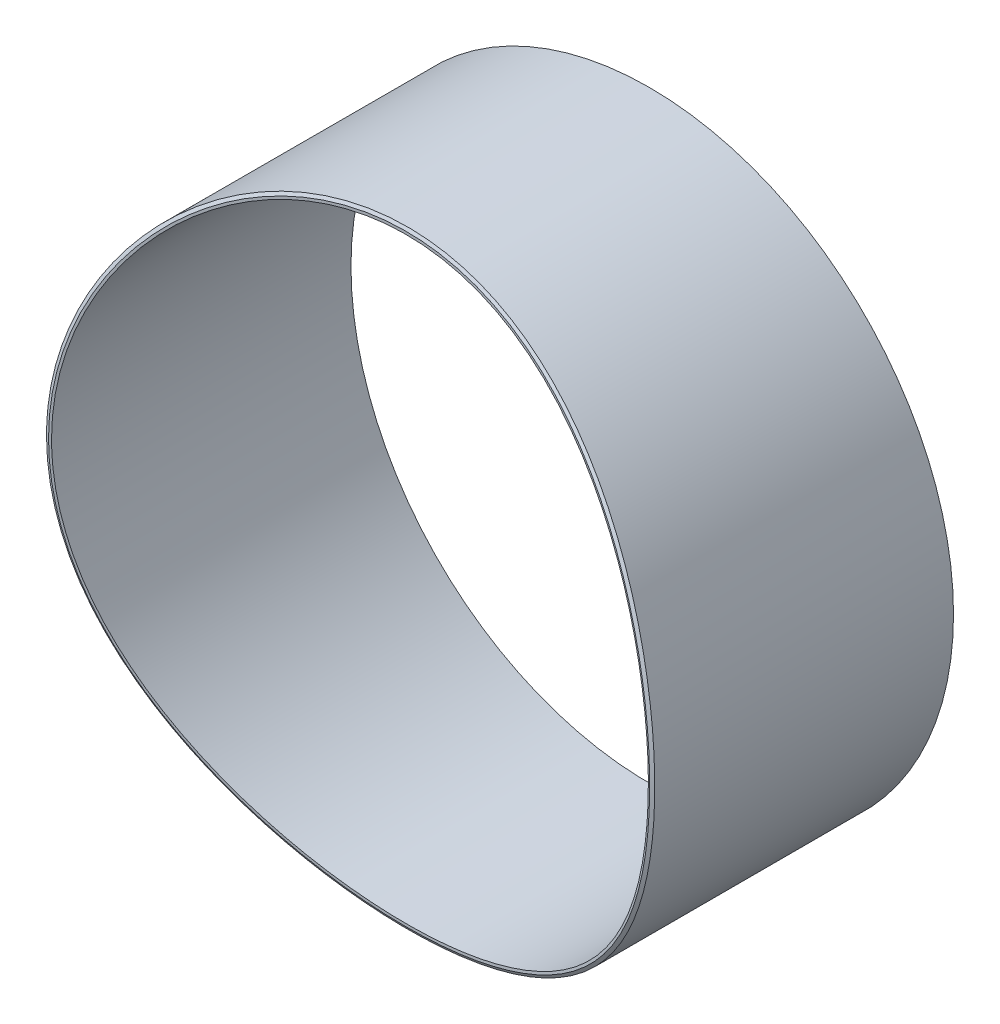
ISO-10303-21;
HEADER;
FILE_DESCRIPTION(('STEP AP214'),'2;1');
FILE_NAME('part.step','',(''),(''),'','','');
FILE_SCHEMA(('AUTOMOTIVE_DESIGN { 1 0 10303 214 1 1 1 1 }'));
ENDSEC;
DATA;
#1=APPLICATION_CONTEXT('core data for automotive mechanical design processes');
#2=APPLICATION_PROTOCOL_DEFINITION('international standard','automotive_design',2000,#1);
#3=PRODUCT_CONTEXT('',#1,'mechanical');
#4=PRODUCT('Part','Part','',(#3));
#5=PRODUCT_RELATED_PRODUCT_CATEGORY('part','',(#4));
#6=PRODUCT_DEFINITION_FORMATION('','',#4);
#7=PRODUCT_DEFINITION_CONTEXT('part definition',#1,'design');
#8=PRODUCT_DEFINITION('design','',#6,#7);
#9=PRODUCT_DEFINITION_SHAPE('','',#8);
#10=(LENGTH_UNIT() NAMED_UNIT(*) SI_UNIT(.MILLI.,.METRE.));
#11=(NAMED_UNIT(*) PLANE_ANGLE_UNIT() SI_UNIT($,.RADIAN.));
#12=(NAMED_UNIT(*) SI_UNIT($,.STERADIAN.) SOLID_ANGLE_UNIT());
#13=UNCERTAINTY_MEASURE_WITH_UNIT(LENGTH_MEASURE(1.E-05),#10,'distance_accuracy_value','');
#14=(GEOMETRIC_REPRESENTATION_CONTEXT(3) GLOBAL_UNCERTAINTY_ASSIGNED_CONTEXT((#13)) GLOBAL_UNIT_ASSIGNED_CONTEXT((#10,
#11,#12)) REPRESENTATION_CONTEXT('',''));
#15=CARTESIAN_POINT('',(0.,0.,0.));
#16=DIRECTION('',(0.,0.,1.));
#17=DIRECTION('',(1.,0.,0.));
#18=AXIS2_PLACEMENT_3D('',#15,#16,#17);
#19=CARTESIAN_POINT('',(0.,0.,0.));
#20=DIRECTION('',(0.,0.,1.));
#21=DIRECTION('',(1.,0.,0.));
#22=AXIS2_PLACEMENT_3D('',#19,#20,#21);
#23=PLANE('',#22);
#24=CARTESIAN_POINT('',(0.,0.,0.));
#25=DIRECTION('',(0.,0.,1.));
#26=DIRECTION('',(1.,0.,0.));
#27=AXIS2_PLACEMENT_3D('',#24,#25,#26);
#28=CIRCLE('',#27,254.);
#29=CARTESIAN_POINT('',(254.,0.,0.));
#30=VERTEX_POINT('',#29);
#31=EDGE_CURVE('E57',#30,#30,#28,.T.);
#32=ORIENTED_EDGE('',*,*,#31,.F.);
#33=EDGE_LOOP('',(#32));
#34=FACE_BOUND('',#33,.T.);
#35=CARTESIAN_POINT('',(0.,0.,0.));
#36=DIRECTION('',(0.,0.,1.));
#37=DIRECTION('',(1.,0.,0.));
#38=AXIS2_PLACEMENT_3D('',#35,#36,#37);
#39=CIRCLE('',#38,249.2375);
#40=CARTESIAN_POINT('',(249.2375,0.,0.));
#41=VERTEX_POINT('',#40);
#42=EDGE_CURVE('E63',#41,#41,#39,.T.);
#43=ORIENTED_EDGE('',*,*,#42,.T.);
#44=EDGE_LOOP('',(#43));
#45=FACE_BOUND('',#44,.T.);
#46=ADVANCED_FACE('F39',(#34,#45),#23,.F.);
#47=CARTESIAN_POINT('',(0.,0.,508.));
#48=DIRECTION('',(0.,0.,-1.));
#49=DIRECTION('',(-1.,0.,0.));
#50=AXIS2_PLACEMENT_3D('',#47,#48,#49);
#51=CYLINDRICAL_SURFACE('',#50,254.);
#52=CARTESIAN_POINT('',(-254.,0.,249.52753161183));
#53=CARTESIAN_POINT('',(-254.000013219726,-2.11197108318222,249.527536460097));
#54=CARTESIAN_POINT('',(-253.97357207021,-4.2238286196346,249.517208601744));
#55=CARTESIAN_POINT('',(-253.868065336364,-8.44463963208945,249.476082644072));
#56=CARTESIAN_POINT('',(-253.789034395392,-10.5535941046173,249.4452980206));
#57=CARTESIAN_POINT('',(-253.474367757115,-16.857481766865,249.322895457));
#58=CARTESIAN_POINT('',(-253.161151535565,-21.048267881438,249.201224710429));
#59=CARTESIAN_POINT('',(-252.329722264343,-29.3796680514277,248.879192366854));
#60=CARTESIAN_POINT('',(-251.81280324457,-33.5204319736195,248.679327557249));
#61=CARTESIAN_POINT('',(-250.578238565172,-41.7583795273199,248.204515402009));
#62=CARTESIAN_POINT('',(-249.861032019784,-45.8556383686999,247.929732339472));
#63=CARTESIAN_POINT('',(-248.227084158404,-54.005407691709,247.307518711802));
#64=CARTESIAN_POINT('',(-247.310303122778,-58.0579090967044,246.960073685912));
#65=CARTESIAN_POINT('',(-245.278942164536,-66.1169108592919,246.196271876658));
#66=CARTESIAN_POINT('',(-244.163890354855,-70.1232766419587,245.77975085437));
#67=CARTESIAN_POINT('',(-241.732497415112,-78.0951457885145,244.879720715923));
#68=CARTESIAN_POINT('',(-240.414913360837,-82.0602233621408,244.395799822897));
#69=CARTESIAN_POINT('',(-237.583554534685,-89.9298298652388,243.367047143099));
#70=CARTESIAN_POINT('',(-236.069014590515,-93.8340524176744,242.821978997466));
#71=CARTESIAN_POINT('',(-232.859137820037,-101.538380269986,241.680743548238));
#72=CARTESIAN_POINT('',(-231.16466293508,-105.33888127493,241.084822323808));
#73=CARTESIAN_POINT('',(-227.603402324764,-112.826624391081,239.84951172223));
#74=CARTESIAN_POINT('',(-225.737542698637,-116.5143465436,239.210360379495));
#75=CARTESIAN_POINT('',(-221.835496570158,-123.78208400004,237.893737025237));
#76=CARTESIAN_POINT('',(-219.799646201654,-127.362293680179,237.216341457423));
#77=CARTESIAN_POINT('',(-215.558593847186,-134.415508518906,235.828702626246));
#78=CARTESIAN_POINT('',(-213.353353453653,-137.888489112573,235.118451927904));
#79=CARTESIAN_POINT('',(-208.774714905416,-144.727671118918,233.670581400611));
#80=CARTESIAN_POINT('',(-206.400945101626,-148.093611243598,232.932902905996));
#81=CARTESIAN_POINT('',(-201.480954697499,-154.721405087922,231.434612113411));
#82=CARTESIAN_POINT('',(-198.933857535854,-157.982584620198,230.673896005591));
#83=CARTESIAN_POINT('',(-193.675301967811,-164.386842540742,229.137879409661));
#84=CARTESIAN_POINT('',(-190.963273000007,-167.529441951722,228.362535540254));
#85=CARTESIAN_POINT('',(-185.400114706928,-173.665701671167,226.810264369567));
#86=CARTESIAN_POINT('',(-182.549563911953,-176.659890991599,226.033354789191));
#87=CARTESIAN_POINT('',(-176.71894515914,-182.492080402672,224.485811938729));
#88=CARTESIAN_POINT('',(-173.739547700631,-185.330747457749,223.71516632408));
#89=CARTESIAN_POINT('',(-167.649590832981,-190.857217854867,222.184523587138));
#90=CARTESIAN_POINT('',(-164.539228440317,-193.545234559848,221.424512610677));
#91=CARTESIAN_POINT('',(-158.187036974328,-198.770655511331,219.920378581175));
#92=CARTESIAN_POINT('',(-154.945124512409,-201.307961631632,219.176266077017));
#93=CARTESIAN_POINT('',(-149.987494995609,-204.997155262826,218.076787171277));
#94=CARTESIAN_POINT('',(-148.317604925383,-206.208468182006,217.712754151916));
#95=CARTESIAN_POINT('',(-144.945409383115,-208.592806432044,216.990671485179));
#96=CARTESIAN_POINT('',(-143.243057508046,-209.765769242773,216.632632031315));
#97=CARTESIAN_POINT('',(-138.074905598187,-213.233774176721,215.566273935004));
#98=CARTESIAN_POINT('',(-134.564222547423,-215.465852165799,214.869327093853));
#99=CARTESIAN_POINT('',(-127.430566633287,-219.760160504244,213.511172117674));
#100=CARTESIAN_POINT('',(-123.807523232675,-221.822281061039,212.849987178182));
#101=CARTESIAN_POINT('',(-118.303851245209,-224.776536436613,211.891914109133));
#102=CARTESIAN_POINT('',(-116.461991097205,-225.736132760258,211.578839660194));
#103=CARTESIAN_POINT('',(-112.757565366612,-227.608993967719,210.964517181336));
#104=CARTESIAN_POINT('',(-110.895047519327,-228.522346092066,210.66324714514));
#105=CARTESIAN_POINT('',(-105.280043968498,-231.190911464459,209.778529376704));
#106=CARTESIAN_POINT('',(-101.492428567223,-232.878756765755,209.212832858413));
#107=CARTESIAN_POINT('',(-93.8351334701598,-236.068088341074,208.134815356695));
#108=CARTESIAN_POINT('',(-89.9655070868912,-237.569691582,207.622460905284));
#109=CARTESIAN_POINT('',(-82.1453127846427,-240.385874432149,206.654465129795));
#110=CARTESIAN_POINT('',(-78.1946358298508,-241.700180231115,206.198906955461));
#111=CARTESIAN_POINT('',(-70.2058457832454,-244.140634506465,205.347933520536));
#112=CARTESIAN_POINT('',(-66.1673781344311,-245.265739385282,204.952852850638));
#113=CARTESIAN_POINT('',(-58.01949856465,-247.320118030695,204.227804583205));
#114=CARTESIAN_POINT('',(-53.9098830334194,-248.248669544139,203.898077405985));
#115=CARTESIAN_POINT('',(-45.6636632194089,-249.89700040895,203.310619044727));
#116=CARTESIAN_POINT('',(-41.5272706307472,-250.617722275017,203.052563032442));
#117=CARTESIAN_POINT('',(-33.2423808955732,-251.85008714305,202.610031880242));
#118=CARTESIAN_POINT('',(-29.0940688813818,-252.362835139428,202.425167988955));
#119=CARTESIAN_POINT('',(-20.7823441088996,-253.182754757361,202.129182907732));
#120=CARTESIAN_POINT('',(-16.6189737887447,-253.490306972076,202.017925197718));
#121=CARTESIAN_POINT('',(-8.2782265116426,-253.899605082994,201.869703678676));
#122=CARTESIAN_POINT('',(-4.10084248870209,-254.001223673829,201.832785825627));
#123=CARTESIAN_POINT('',(4.2674623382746,-253.998749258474,201.833682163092));
#124=CARTESIAN_POINT('',(8.45838293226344,-253.893985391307,201.871740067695));
#125=CARTESIAN_POINT('',(16.8556702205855,-253.475484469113,202.023290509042));
#126=CARTESIAN_POINT('',(21.0619608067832,-253.160396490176,202.13727068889));
#127=CARTESIAN_POINT('',(29.453019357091,-252.321785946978,202.439968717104));
#128=CARTESIAN_POINT('',(33.6377761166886,-251.798164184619,202.628722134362));
#129=CARTESIAN_POINT('',(41.9446171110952,-250.547878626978,203.077584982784));
#130=CARTESIAN_POINT('',(46.0669327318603,-249.822578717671,203.337214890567));
#131=CARTESIAN_POINT('',(54.2485477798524,-248.174213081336,203.924534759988));
#132=CARTESIAN_POINT('',(58.3080408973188,-247.252003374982,204.251929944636));
#133=CARTESIAN_POINT('',(66.365511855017,-245.212099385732,204.971716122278));
#134=CARTESIAN_POINT('',(70.3635688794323,-244.094684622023,205.364014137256));
#135=CARTESIAN_POINT('',(78.2998420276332,-241.665740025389,206.210856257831));
#136=CARTESIAN_POINT('',(82.2379681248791,-240.353944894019,206.66548537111));
#137=CARTESIAN_POINT('',(88.0929841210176,-238.243053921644,207.39096071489));
#138=CARTESIAN_POINT('',(90.0382991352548,-237.514581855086,207.640371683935));
#139=CARTESIAN_POINT('',(93.9130095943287,-236.009572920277,208.153446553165));
#140=CARTESIAN_POINT('',(95.8423643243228,-235.232940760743,208.417138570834));
#141=CARTESIAN_POINT('',(101.619709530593,-232.823893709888,209.231299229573));
#142=CARTESIAN_POINT('',(105.43532713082,-231.120123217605,209.802163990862));
#143=CARTESIAN_POINT('',(112.974140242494,-227.530162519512,210.991980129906));
#144=CARTESIAN_POINT('',(116.697294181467,-225.643892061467,211.610952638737));
#145=CARTESIAN_POINT('',(122.194411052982,-222.685437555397,212.569885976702));
#146=CARTESIAN_POINT('',(124.007657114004,-221.680509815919,212.893743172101));
#147=CARTESIAN_POINT('',(127.60419035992,-219.62975049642,213.550464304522));
#148=CARTESIAN_POINT('',(129.387531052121,-218.584006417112,213.883308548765));
#149=CARTESIAN_POINT('',(134.688411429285,-215.387948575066,214.893728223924));
#150=CARTESIAN_POINT('',(138.16542908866,-213.174168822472,215.584699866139));
#151=CARTESIAN_POINT('',(144.99882076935,-208.586435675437,216.995159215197));
#152=CARTESIAN_POINT('',(148.35535292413,-206.212704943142,217.7146067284));
#153=CARTESIAN_POINT('',(154.949661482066,-201.304754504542,219.177238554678));
#154=CARTESIAN_POINT('',(158.187300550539,-198.770357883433,219.920448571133));
#155=CARTESIAN_POINT('',(164.544643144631,-193.540861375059,221.425787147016));
#156=CARTESIAN_POINT('',(167.663906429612,-190.845242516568,222.18797161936));
#157=CARTESIAN_POINT('',(173.783797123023,-185.290262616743,223.726351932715));
#158=CARTESIAN_POINT('',(176.783628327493,-182.430039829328,224.502603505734));
#159=CARTESIAN_POINT('',(182.640791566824,-176.565902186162,226.057955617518));
#160=CARTESIAN_POINT('',(185.498073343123,-173.561937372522,226.837057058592));
#161=CARTESIAN_POINT('',(191.047858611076,-167.433024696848,228.386507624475));
#162=CARTESIAN_POINT('',(193.741149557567,-164.308796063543,229.15688122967));
#163=CARTESIAN_POINT('',(198.966206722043,-157.94100219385,230.683581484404));
#164=CARTESIAN_POINT('',(201.498433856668,-154.697823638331,231.439943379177));
#165=CARTESIAN_POINT('',(206.402327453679,-148.091521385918,232.933344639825));
#166=CARTESIAN_POINT('',(208.774102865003,-144.728481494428,233.670396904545));
#167=CARTESIAN_POINT('',(213.357458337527,-137.882461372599,235.119740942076));
#168=CARTESIAN_POINT('',(215.568800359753,-134.399313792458,235.831995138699));
#169=CARTESIAN_POINT('',(219.831167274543,-127.308825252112,237.226718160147));
#170=CARTESIAN_POINT('',(221.881439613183,-123.701003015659,237.909041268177));
#171=CARTESIAN_POINT('',(225.813915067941,-116.367464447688,239.236334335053));
#172=CARTESIAN_POINT('',(227.695349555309,-112.641304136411,239.881129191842));
#173=CARTESIAN_POINT('',(231.269923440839,-105.106491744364,241.121705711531));
#174=CARTESIAN_POINT('',(232.963639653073,-101.298137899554,241.717635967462));
#175=CARTESIAN_POINT('',(236.155095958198,-93.6162334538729,242.852862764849));
#176=CARTESIAN_POINT('',(237.653837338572,-89.7431414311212,243.392445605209));
#177=CARTESIAN_POINT('',(240.459858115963,-81.9278001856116,244.412268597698));
#178=CARTESIAN_POINT('',(241.767445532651,-77.9856739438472,244.892604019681));
#179=CARTESIAN_POINT('',(244.189848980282,-70.0329327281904,245.789415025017));
#180=CARTESIAN_POINT('',(245.304563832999,-66.0222830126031,246.205857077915));
#181=CARTESIAN_POINT('',(246.829653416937,-59.9606626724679,246.779359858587));
#182=CARTESIAN_POINT('',(247.31393697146,-57.9304268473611,246.962160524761));
#183=CARTESIAN_POINT('',(248.233814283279,-53.8534340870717,247.31044488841));
#184=CARTESIAN_POINT('',(248.669314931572,-51.8066532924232,247.475895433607));
#185=CARTESIAN_POINT('',(249.903750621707,-45.6275256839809,247.946057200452));
#186=CARTESIAN_POINT('',(250.625341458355,-41.4773082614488,248.222585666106));
#187=CARTESIAN_POINT('',(251.863007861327,-33.1428405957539,248.698696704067));
#188=CARTESIAN_POINT('',(252.379127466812,-28.9585978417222,248.898295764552));
#189=CARTESIAN_POINT('',(252.994383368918,-22.6762470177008,249.136650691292));
#190=CARTESIAN_POINT('',(253.172712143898,-20.5867828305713,249.205823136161));
#191=CARTESIAN_POINT('',(253.477658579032,-16.4075864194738,249.324211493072));
#192=CARTESIAN_POINT('',(253.604375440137,-14.3178625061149,249.37346568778));
#193=CARTESIAN_POINT('',(253.90653609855,-8.05298398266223,249.49101177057));
#194=CARTESIAN_POINT('',(254.004857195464,-3.87326576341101,249.529423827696));
#195=CARTESIAN_POINT('',(253.994775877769,4.48384123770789,249.525496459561));
#196=CARTESIAN_POINT('',(253.886474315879,8.66123016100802,249.483196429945));
#197=CARTESIAN_POINT('',(253.56965276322,14.9203443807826,249.359962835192));
#198=CARTESIAN_POINT('',(253.43818848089,17.0068398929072,249.308871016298));
#199=CARTESIAN_POINT('',(253.12395237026,21.1779063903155,249.186899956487));
#200=CARTESIAN_POINT('',(252.941119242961,23.2624720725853,249.115997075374));
#201=CARTESIAN_POINT('',(252.312766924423,29.5298720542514,248.872633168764));
#202=CARTESIAN_POINT('',(251.788522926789,33.7039073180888,248.66995772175));
#203=CARTESIAN_POINT('',(250.533504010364,42.0291162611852,248.187354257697));
#204=CARTESIAN_POINT('',(249.802114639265,46.1801838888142,247.90719646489));
#205=CARTESIAN_POINT('',(248.552989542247,52.3623757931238,247.431681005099));
#206=CARTESIAN_POINT('',(248.112341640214,54.4115122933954,247.264365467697));
#207=CARTESIAN_POINT('',(247.183038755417,58.4881580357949,246.912718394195));
#208=CARTESIAN_POINT('',(246.694596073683,60.515722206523,246.728462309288));
#209=CARTESIAN_POINT('',(245.159470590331,66.5594774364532,246.151563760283));
#210=CARTESIAN_POINT('',(244.039325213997,70.5548529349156,245.733388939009));
#211=CARTESIAN_POINT('',(241.611234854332,78.4670705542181,244.83511059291));
#212=CARTESIAN_POINT('',(240.303883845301,82.3841180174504,244.355203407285));
#213=CARTESIAN_POINT('',(237.503328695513,90.1402894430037,243.338119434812));
#214=CARTESIAN_POINT('',(236.010262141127,93.9794686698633,242.800985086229));
#215=CARTESIAN_POINT('',(232.83905563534,101.582074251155,241.673711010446));
#216=CARTESIAN_POINT('',(231.160548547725,105.345332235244,241.08346658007));
#217=CARTESIAN_POINT('',(228.507182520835,110.925757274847,240.163042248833));
#218=CARTESIAN_POINT('',(227.598788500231,112.777647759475,239.849938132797));
#219=CARTESIAN_POINT('',(225.736288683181,116.46131515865,239.212434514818));
#220=CARTESIAN_POINT('',(224.782091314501,118.293041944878,238.888012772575));
#221=CARTESIAN_POINT('',(221.841229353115,123.773145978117,237.895592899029));
#222=CARTESIAN_POINT('',(219.787434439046,127.382988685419,237.212321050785));
#223=CARTESIAN_POINT('',(215.504273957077,134.502470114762,235.81112008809));
#224=CARTESIAN_POINT('',(213.274487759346,138.011839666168,235.093109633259));
#225=CARTESIAN_POINT('',(209.808907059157,143.179927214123,233.997831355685));
#226=CARTESIAN_POINT('',(208.636079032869,144.883249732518,233.63046300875));
#227=CARTESIAN_POINT('',(206.25290938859,148.256015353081,232.891073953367));
#228=CARTESIAN_POINT('',(205.042665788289,149.92553068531,232.519066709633));
#229=CARTESIAN_POINT('',(201.358354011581,154.879710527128,231.397888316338));
#230=CARTESIAN_POINT('',(198.824781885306,158.118839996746,230.641681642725));
#231=CARTESIAN_POINT('',(193.608890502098,164.464192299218,229.118845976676));
#232=CARTESIAN_POINT('',(190.926789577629,167.570598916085,228.352233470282));
#233=CARTESIAN_POINT('',(185.413207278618,173.651651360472,226.813862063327));
#234=CARTESIAN_POINT('',(182.581599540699,176.626181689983,226.04209930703));
#235=CARTESIAN_POINT('',(176.768630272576,182.444023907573,224.498760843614));
#236=CARTESIAN_POINT('',(173.78683736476,185.286906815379,223.727192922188));
#237=CARTESIAN_POINT('',(167.669546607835,190.840830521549,222.189255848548));
#238=CARTESIAN_POINT('',(164.53327246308,193.55103148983,221.422941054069));
#239=CARTESIAN_POINT('',(158.127789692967,198.818486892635,219.90651218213));
#240=CARTESIAN_POINT('',(154.858502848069,201.375649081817,219.156408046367));
#241=CARTESIAN_POINT('',(148.212310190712,206.315883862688,217.683543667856));
#242=CARTESIAN_POINT('',(144.836055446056,208.699795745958,216.960661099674));
#243=CARTESIAN_POINT('',(137.977946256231,213.295749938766,215.546949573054));
#244=CARTESIAN_POINT('',(134.496459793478,215.508312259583,214.856026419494));
#245=CARTESIAN_POINT('',(127.427020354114,219.76228527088,213.51050441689));
#246=CARTESIAN_POINT('',(123.839143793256,221.803814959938,212.855880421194));
#247=CARTESIAN_POINT('',(116.557138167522,225.715600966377,211.587466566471));
#248=CARTESIAN_POINT('',(112.862859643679,227.585599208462,210.973738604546));
#249=CARTESIAN_POINT('',(105.36342825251,231.153592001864,209.791028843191));
#250=CARTESIAN_POINT('',(101.557837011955,232.850739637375,209.222270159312));
#251=CARTESIAN_POINT('',(93.8449977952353,236.064745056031,208.135977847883));
#252=CARTESIAN_POINT('',(89.9373900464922,237.580815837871,207.61866935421));
#253=CARTESIAN_POINT('',(82.0598332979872,240.415190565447,206.644336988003));
#254=CARTESIAN_POINT('',(78.0901602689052,241.734188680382,206.187102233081));
#255=CARTESIAN_POINT('',(70.1060100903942,244.168986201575,205.337992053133));
#256=CARTESIAN_POINT('',(66.0918963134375,245.285856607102,204.94577312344));
#257=CARTESIAN_POINT('',(58.0147795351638,247.320654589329,204.227601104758));
#258=CARTESIAN_POINT('',(53.9518672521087,248.238904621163,203.90154066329));
#259=CARTESIAN_POINT('',(45.7782074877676,249.875451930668,203.318315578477));
#260=CARTESIAN_POINT('',(41.6674320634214,250.593625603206,203.061193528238));
#261=CARTESIAN_POINT('',(35.4718207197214,251.519223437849,202.728850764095));
#262=CARTESIAN_POINT('',(33.3994828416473,251.802700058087,202.626879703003));
#263=CARTESIAN_POINT('',(29.2436131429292,252.319326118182,202.440807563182));
#264=CARTESIAN_POINT('',(27.1600673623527,252.55237614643,202.356741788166));
#265=CARTESIAN_POINT('',(20.8785651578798,253.175642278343,202.131756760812));
#266=CARTESIAN_POINT('',(16.6714716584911,253.486713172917,202.019224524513));
#267=CARTESIAN_POINT('',(8.24756931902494,253.900406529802,201.869411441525));
#268=CARTESIAN_POINT('',(4.03076559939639,254.003121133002,201.832097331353));
#269=CARTESIAN_POINT('',(-2.28172081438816,253.998346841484,201.833828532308));
#270=CARTESIAN_POINT('',(-4.37773604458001,253.970587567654,201.843911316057));
#271=CARTESIAN_POINT('',(-8.56385265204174,253.863691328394,201.882680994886));
#272=CARTESIAN_POINT('',(-10.6539571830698,253.784662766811,201.911328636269));
#273=CARTESIAN_POINT('',(-16.9099989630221,253.470643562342,202.025039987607));
#274=CARTESIAN_POINT('',(-21.0718678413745,253.158711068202,202.137875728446));
#275=CARTESIAN_POINT('',(-29.3674578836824,252.331026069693,202.436636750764));
#276=CARTESIAN_POINT('',(-33.5012064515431,251.815514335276,202.622475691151));
#277=CARTESIAN_POINT('',(-41.7411940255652,250.581527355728,203.065531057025));
#278=CARTESIAN_POINT('',(-45.8473791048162,249.862732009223,203.322860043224));
#279=CARTESIAN_POINT('',(-54.0345596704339,248.221195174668,203.907840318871));
#280=CARTESIAN_POINT('',(-58.1153355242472,247.297478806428,204.235827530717));
#281=CARTESIAN_POINT('',(-66.2444465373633,245.245368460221,204.960030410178));
#282=CARTESIAN_POINT('',(-70.2924536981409,244.115812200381,205.356632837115));
#283=CARTESIAN_POINT('',(-78.3124379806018,241.662517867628,206.211994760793));
#284=CARTESIAN_POINT('',(-82.2845656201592,240.339222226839,206.670612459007));
#285=CARTESIAN_POINT('',(-90.1263772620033,237.509323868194,207.643114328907));
#286=CARTESIAN_POINT('',(-93.996560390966,236.003972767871,208.156618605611));
#287=CARTESIAN_POINT('',(-101.641267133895,232.813519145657,209.234746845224));
#288=CARTESIAN_POINT('',(-105.416038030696,231.128956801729,209.79921645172));
#289=CARTESIAN_POINT('',(-112.86995003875,227.581883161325,210.974948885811));
#290=CARTESIAN_POINT('',(-116.549160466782,225.719505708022,211.58617645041));
#291=CARTESIAN_POINT('',(-123.813620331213,221.817904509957,212.851335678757));
#292=CARTESIAN_POINT('',(-127.398696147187,219.778380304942,213.505339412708));
#293=CARTESIAN_POINT('',(-132.69943946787,216.589545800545,214.514015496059));
#294=CARTESIAN_POINT('',(-134.455952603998,215.503394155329,214.855351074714));
#295=CARTESIAN_POINT('',(-137.945423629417,213.286753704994,215.547072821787));
#296=CARTESIAN_POINT('',(-139.67831024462,212.156159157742,215.897479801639));
#297=CARTESIAN_POINT('',(-144.848841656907,208.691415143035,216.963252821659));
#298=CARTESIAN_POINT('',(-148.242068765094,206.294095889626,217.690062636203));
#299=CARTESIAN_POINT('',(-154.900881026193,201.342149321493,219.166195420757));
#300=CARTESIAN_POINT('',(-158.166597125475,198.787690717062,219.915493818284));
#301=CARTESIAN_POINT('',(-162.957805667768,194.846029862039,221.050070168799));
#302=CARTESIAN_POINT('',(-164.533168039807,193.517278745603,221.429071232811));
#303=CARTESIAN_POINT('',(-167.648658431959,190.824366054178,222.189755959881));
#304=CARTESIAN_POINT('',(-169.188832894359,189.46025691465,222.571435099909));
#305=CARTESIAN_POINT('',(-173.75342588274,185.317402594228,223.718780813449));
#306=CARTESIAN_POINT('',(-176.727356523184,182.483652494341,224.488049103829));
#307=CARTESIAN_POINT('',(-182.531968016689,176.677505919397,226.028679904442));
#308=CARTESIAN_POINT('',(-185.362736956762,173.705196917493,226.800040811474));
#309=CARTESIAN_POINT('',(-190.881840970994,167.621640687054,228.339516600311));
#310=CARTESIAN_POINT('',(-193.569950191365,164.510186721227,229.107624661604));
#311=CARTESIAN_POINT('',(-198.805502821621,158.14365883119,230.635906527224));
#312=CARTESIAN_POINT('',(-201.352221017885,154.887975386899,231.39602564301));
#313=CARTESIAN_POINT('',(-206.29640223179,148.239391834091,232.900641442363));
#314=CARTESIAN_POINT('',(-208.693183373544,144.845966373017,233.645057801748));
#315=CARTESIAN_POINT('',(-213.313066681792,137.952061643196,235.10546058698));
#316=CARTESIAN_POINT('',(-215.536665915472,134.451932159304,235.821525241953));
#317=CARTESIAN_POINT('',(-219.801605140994,127.359449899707,237.216957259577));
#318=CARTESIAN_POINT('',(-221.843791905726,123.767638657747,237.896488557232));
#319=CARTESIAN_POINT('',(-225.750454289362,116.489288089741,239.214764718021));
#320=CARTESIAN_POINT('',(-227.615222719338,112.802918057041,239.853576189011));
#321=CARTESIAN_POINT('',(-231.165880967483,105.335378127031,241.085274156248));
#322=CARTESIAN_POINT('',(-232.851688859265,101.554165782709,241.678139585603));
#323=CARTESIAN_POINT('',(-236.04408469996,93.8959651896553,242.81307131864));
#324=CARTESIAN_POINT('',(-237.550128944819,90.0187271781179,243.354982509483));
#325=CARTESIAN_POINT('',(-240.379761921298,82.1657068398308,244.382905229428));
#326=CARTESIAN_POINT('',(-241.702268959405,78.1894907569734,244.868582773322));
#327=CARTESIAN_POINT('',(-244.150979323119,70.1702785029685,245.774920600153));
#328=CARTESIAN_POINT('',(-245.277207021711,66.127290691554,246.195588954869));
#329=CARTESIAN_POINT('',(-247.322659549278,58.0087661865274,246.964709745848));
#330=CARTESIAN_POINT('',(-248.243097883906,53.9335753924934,247.31358451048));
#331=CARTESIAN_POINT('',(-249.880287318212,45.7513949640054,247.937097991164));
#332=CARTESIAN_POINT('',(-250.597724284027,41.6445617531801,248.211986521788));
#333=CARTESIAN_POINT('',(-251.829235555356,33.3990570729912,248.685660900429));
#334=CARTESIAN_POINT('',(-252.343447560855,29.2604091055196,248.88449827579));
#335=CARTESIAN_POINT('',(-253.168857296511,20.952235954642,249.204219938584));
#336=CARTESIAN_POINT('',(-253.479691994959,16.7826689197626,249.32496482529));
#337=CARTESIAN_POINT('',(-253.79125484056,10.5123964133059,249.446161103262));
#338=CARTESIAN_POINT('',(-253.869327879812,8.41581909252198,249.476573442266));
#339=CARTESIAN_POINT('',(-253.973766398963,4.21286353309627,249.517284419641));
#340=CARTESIAN_POINT('',(-253.999925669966,2.10647938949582,249.527502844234));
#341=CARTESIAN_POINT('',(-254.,0.,249.52753161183));
#342=B_SPLINE_CURVE_WITH_KNOTS('',3,(#52,#53,#54,#55,#56,#57,#58,#59,#60,#61,#62,#63,#64,#65,
#66,#67,#68,#69,#70,#71,#72,#73,#74,#75,#76,#77,#78,#79,#80,#81,#82,#83,#84,#85,#86,#87,#88,#89,
#90,#91,#92,#93,#94,#95,#96,#97,#98,#99,#100,#101,#102,#103,#104,#105,#106,#107,#108,#109,#110,
#111,#112,#113,#114,#115,#116,#117,#118,#119,#120,#121,#122,#123,#124,#125,#126,#127,#128,#129,
#130,#131,#132,#133,#134,#135,#136,#137,#138,#139,#140,#141,#142,#143,#144,#145,#146,#147,#148,
#149,#150,#151,#152,#153,#154,#155,#156,#157,#158,#159,#160,#161,#162,#163,#164,#165,#166,#167,
#168,#169,#170,#171,#172,#173,#174,#175,#176,#177,#178,#179,#180,#181,#182,#183,#184,#185,#186,
#187,#188,#189,#190,#191,#192,#193,#194,#195,#196,#197,#198,#199,#200,#201,#202,#203,#204,#205,
#206,#207,#208,#209,#210,#211,#212,#213,#214,#215,#216,#217,#218,#219,#220,#221,#222,#223,#224,
#225,#226,#227,#228,#229,#230,#231,#232,#233,#234,#235,#236,#237,#238,#239,#240,#241,#242,#243,
#244,#245,#246,#247,#248,#249,#250,#251,#252,#253,#254,#255,#256,#257,#258,#259,#260,#261,#262,
#263,#264,#265,#266,#267,#268,#269,#270,#271,#272,#273,#274,#275,#276,#277,#278,#279,#280,#281,
#282,#283,#284,#285,#286,#287,#288,#289,#290,#291,#292,#293,#294,#295,#296,#297,#298,#299,#300,
#301,#302,#303,#304,#305,#306,#307,#308,#309,#310,#311,#312,#313,#314,#315,#316,#317,#318,#319,
#320,#321,#322,#323,#324,#325,#326,#327,#328,#329,#330,#331,#332,#333,#334,#335,#336,#337,#338,
#339,#340,#341),.UNSPECIFIED.,.F.,.F.,(4,2,2,2,2,2,2,2,2,2,2,2,2,2,2,2,2,2,2,2,2,2,2,2,2,2,2,2,
2,2,2,2,2,2,2,2,2,2,2,2,2,2,2,2,2,2,2,2,2,2,2,2,2,2,2,2,2,2,2,2,2,2,2,2,2,2,2,2,2,2,2,2,2,2,2,2,
2,2,2,2,2,2,2,2,2,2,2,2,2,2,2,2,2,2,2,2,2,2,2,2,2,2,2,2,2,2,2,2,2,2,2,2,2,2,2,2,2,2,2,2,2,2,2,2,
2,2,2,2,2,2,2,2,2,2,2,2,2,2,2,2,2,2,2,2,4),(0.,6.33549914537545,12.6668289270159,
25.2730745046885,37.8004969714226,50.3006668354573,62.8033267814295,75.3361515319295,
87.9492094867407,100.612820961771,113.218295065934,125.759265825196,138.276000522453,
150.795581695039,163.343684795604,175.96079289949,188.62434979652,201.238930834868,
213.794320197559,226.331453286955,238.87666167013,245.160643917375,251.454405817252,
264.10347870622,276.760659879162,283.061003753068,289.348981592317,301.89850958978,
314.440115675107,326.999872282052,339.626782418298,352.299315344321,364.913440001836,
377.459637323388,389.982499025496,402.513099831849,415.084499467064,427.737433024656,
440.396392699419,452.971742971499,465.493499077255,477.997469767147,490.518666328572,
496.79457852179,503.083331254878,515.730265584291,528.38278675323,534.676952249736,
540.958295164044,553.491298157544,566.007201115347,578.537133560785,591.109831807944,
603.755710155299,616.40601599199,628.989802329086,641.535786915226,654.073165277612,
666.628780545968,679.239944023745,691.905879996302,704.531749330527,717.089978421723,
729.627743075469,742.172065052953,748.457022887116,754.753779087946,767.412194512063,
780.067895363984,786.361843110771,792.643635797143,805.180538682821,817.711323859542,
823.98446483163,830.265123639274,842.89395625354,855.560649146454,861.867959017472,
868.148424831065,880.653799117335,893.120340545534,905.577700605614,918.060181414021,
924.318591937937,930.59008292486,943.211746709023,955.864547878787,962.165284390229,
968.450719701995,980.98922989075,993.509774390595,1006.04107616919,1018.61069014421,
1031.25164198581,1043.90013807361,1056.48258992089,1069.02522438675,1081.55905836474,
1094.11145082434,1106.72265346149,1119.38681318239,1132.00525606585,1144.55474505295,
1157.08370474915,1169.62038763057,1175.90214328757,1182.1961722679,1194.85015218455,
1207.49853494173,1213.78655849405,1220.06132978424,1232.58030007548,1245.08450850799,
1257.6085174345,1270.1934362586,1282.85175160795,1295.48159815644,1308.02908541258,
1320.53976973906,1333.04111029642,1345.56408478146,1351.84321815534,1358.13832206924,
1370.78623855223,1383.42080509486,1389.70667623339,1395.98370596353,1408.51629066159,
1421.04106785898,1433.58511599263,1446.18847659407,1458.84551512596,1471.46477308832,
1484.02163868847,1496.55740726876,1509.09889007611,1521.67739243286,1534.32713628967,
1546.97530824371,1559.5468043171,1572.07530449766,1584.59530107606,1597.13758551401,
1603.43169514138,1609.75075622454),.UNSPECIFIED.);
#343=CARTESIAN_POINT('',(-254.,0.,249.52753161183));
#344=VERTEX_POINT('',#343);
#345=EDGE_CURVE('E51',#344,#344,#342,.F.);
#346=ORIENTED_EDGE('',*,*,#345,.T.);
#347=EDGE_LOOP('',(#346));
#348=FACE_BOUND('',#347,.T.);
#349=ORIENTED_EDGE('',*,*,#31,.T.);
#350=EDGE_LOOP('',(#349));
#351=FACE_BOUND('',#350,.T.);
#352=ADVANCED_FACE('F106',(#348,#351),#51,.T.);
#353=CARTESIAN_POINT('',(0.,0.,508.));
#354=DIRECTION('',(0.,0.,-1.));
#355=DIRECTION('',(-1.,0.,0.));
#356=AXIS2_PLACEMENT_3D('',#353,#354,#355);
#357=CYLINDRICAL_SURFACE('',#356,249.2375);
#358=CARTESIAN_POINT('',(-249.2375,0.,250.092879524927));
#359=CARTESIAN_POINT('',(-249.237501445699,3.37326149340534,250.092880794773));
#360=CARTESIAN_POINT('',(-249.169003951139,6.74648218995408,250.066146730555));
#361=CARTESIAN_POINT('',(-248.895201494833,13.4864829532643,249.959437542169));
#362=CARTESIAN_POINT('',(-248.689898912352,16.8532631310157,249.879463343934));
#363=CARTESIAN_POINT('',(-248.143043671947,23.5738662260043,249.666944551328));
#364=CARTESIAN_POINT('',(-247.801498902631,26.9276898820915,249.534403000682));
#365=CARTESIAN_POINT('',(-246.983045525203,33.6163454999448,249.217843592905));
#366=CARTESIAN_POINT('',(-246.506136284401,36.9511773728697,249.033825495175));
#367=CARTESIAN_POINT('',(-245.418173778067,43.5956959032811,248.615818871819));
#368=CARTESIAN_POINT('',(-244.807121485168,46.905382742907,248.381830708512));
#369=CARTESIAN_POINT('',(-243.452388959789,53.4937013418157,247.865771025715));
#370=CARTESIAN_POINT('',(-242.708708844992,56.7723331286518,247.58369954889));
#371=CARTESIAN_POINT('',(-241.09049626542,63.2928773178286,246.973707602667));
#372=CARTESIAN_POINT('',(-240.215961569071,66.5347890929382,246.645786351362));
#373=CARTESIAN_POINT('',(-238.338078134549,72.9763456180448,245.946655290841));
#374=CARTESIAN_POINT('',(-237.33472937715,76.175990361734,245.575445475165));
#375=CARTESIAN_POINT('',(-235.203946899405,82.5203394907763,244.793489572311));
#376=CARTESIAN_POINT('',(-234.076808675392,85.6651548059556,244.382837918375));
#377=CARTESIAN_POINT('',(-231.69893576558,91.9025267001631,243.524329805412));
#378=CARTESIAN_POINT('',(-230.448201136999,94.9950833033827,243.076473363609));
#379=CARTESIAN_POINT('',(-227.825684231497,101.123175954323,242.146822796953));
#380=CARTESIAN_POINT('',(-226.453903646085,104.158712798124,241.66502914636));
#381=CARTESIAN_POINT('',(-223.591921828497,110.168328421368,240.670926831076));
#382=CARTESIAN_POINT('',(-222.101720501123,113.142407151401,240.158618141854));
#383=CARTESIAN_POINT('',(-219.005370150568,119.025334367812,239.106961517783));
#384=CARTESIAN_POINT('',(-217.399201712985,121.93417182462,238.567609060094));
#385=CARTESIAN_POINT('',(-214.073798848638,127.682284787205,237.465567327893));
#386=CARTESIAN_POINT('',(-212.354554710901,130.52155428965,236.902876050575));
#387=CARTESIAN_POINT('',(-208.806018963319,136.126334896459,235.757960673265));
#388=CARTESIAN_POINT('',(-206.976729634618,138.891847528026,235.175736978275));
#389=CARTESIAN_POINT('',(-203.21096503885,144.345474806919,233.995544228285));
#390=CARTESIAN_POINT('',(-201.274488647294,147.033588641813,233.397575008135));
#391=CARTESIAN_POINT('',(-197.212985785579,152.441081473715,232.164121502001));
#392=CARTESIAN_POINT('',(-195.083446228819,155.156954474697,231.528121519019));
#393=CARTESIAN_POINT('',(-190.714482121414,160.496786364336,230.247536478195));
#394=CARTESIAN_POINT('',(-188.475055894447,163.120743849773,229.602951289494));
#395=CARTESIAN_POINT('',(-183.889876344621,168.272802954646,228.309582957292));
#396=CARTESIAN_POINT('',(-181.5441268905,170.800908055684,227.660799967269));
#397=CARTESIAN_POINT('',(-176.749498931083,175.757894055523,226.363279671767));
#398=CARTESIAN_POINT('',(-174.300609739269,178.186764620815,225.714542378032));
#399=CARTESIAN_POINT('',(-169.303056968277,182.941807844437,224.421353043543));
#400=CARTESIAN_POINT('',(-166.754374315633,185.267960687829,223.776901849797));
#401=CARTESIAN_POINT('',(-161.561675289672,189.813226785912,222.496725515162));
#402=CARTESIAN_POINT('',(-158.917669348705,192.032351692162,221.860999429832));
#403=CARTESIAN_POINT('',(-153.537590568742,196.360537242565,220.602303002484));
#404=CARTESIAN_POINT('',(-150.801507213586,198.469585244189,219.979334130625));
#405=CARTESIAN_POINT('',(-145.241808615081,202.573655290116,218.750373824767));
#406=CARTESIAN_POINT('',(-142.41820121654,204.568687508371,218.144380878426));
#407=CARTESIAN_POINT('',(-136.59615343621,208.503131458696,216.934341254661));
#408=CARTESIAN_POINT('',(-133.595008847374,210.438751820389,216.330970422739));
#409=CARTESIAN_POINT('',(-127.508485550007,214.181420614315,215.150732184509));
#410=CARTESIAN_POINT('',(-124.423106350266,215.988468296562,214.573864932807));
#411=CARTESIAN_POINT('',(-118.173063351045,219.470397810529,213.450706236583));
#412=CARTESIAN_POINT('',(-115.008396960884,221.145275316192,212.904415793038));
#413=CARTESIAN_POINT('',(-108.605200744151,224.359252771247,211.846339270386));
#414=CARTESIAN_POINT('',(-105.366671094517,225.898353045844,211.334553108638));
#415=CARTESIAN_POINT('',(-98.8221412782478,228.837014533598,210.349300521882));
#416=CARTESIAN_POINT('',(-95.5161577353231,230.236609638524,209.875824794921));
#417=CARTESIAN_POINT('',(-88.8418461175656,232.893449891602,208.970509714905));
#418=CARTESIAN_POINT('',(-85.4735178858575,234.150694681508,208.538670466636));
#419=CARTESIAN_POINT('',(-78.680870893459,236.519744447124,207.719835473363));
#420=CARTESIAN_POINT('',(-75.256554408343,237.631555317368,207.332837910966));
#421=CARTESIAN_POINT('',(-68.358319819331,239.706996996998,206.6065593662));
#422=CARTESIAN_POINT('',(-64.8844021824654,240.670629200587,206.267277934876));
#423=CARTESIAN_POINT('',(-58.0362305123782,242.411004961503,205.651795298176));
#424=CARTESIAN_POINT('',(-54.6636846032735,243.19376450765,205.373586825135));
#425=CARTESIAN_POINT('',(-47.8854305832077,244.618704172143,204.865381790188));
#426=CARTESIAN_POINT('',(-44.4797227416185,245.260885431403,204.635384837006));
#427=CARTESIAN_POINT('',(-37.6416167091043,246.403035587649,204.225233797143));
#428=CARTESIAN_POINT('',(-34.2092189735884,246.903006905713,204.04507886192));
#429=CARTESIAN_POINT('',(-27.324264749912,247.759459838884,203.735891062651));
#430=CARTESIAN_POINT('',(-23.8717082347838,248.11594126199,203.606858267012));
#431=CARTESIAN_POINT('',(-16.9540751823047,248.684401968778,203.400867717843));
#432=CARTESIAN_POINT('',(-13.4890021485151,248.896418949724,203.323896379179));
#433=CARTESIAN_POINT('',(-6.55224670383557,249.175537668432,203.222528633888));
#434=CARTESIAN_POINT('',(-3.08056428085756,249.242639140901,203.198132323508));
#435=CARTESIAN_POINT('',(3.86245446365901,249.231747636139,203.202090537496));
#436=CARTESIAN_POINT('',(7.33379079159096,249.153758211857,203.230443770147));
#437=CARTESIAN_POINT('',(14.2693281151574,248.852899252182,203.3396946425));
#438=CARTESIAN_POINT('',(17.7335291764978,248.630031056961,203.420591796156));
#439=CARTESIAN_POINT('',(24.4868698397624,248.053761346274,203.629363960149));
#440=CARTESIAN_POINT('',(27.7766451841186,247.706926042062,203.754874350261));
#441=CARTESIAN_POINT('',(34.337699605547,246.882938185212,204.0523041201));
#442=CARTESIAN_POINT('',(37.6089788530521,246.405786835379,204.22422307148));
#443=CARTESIAN_POINT('',(44.127224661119,245.322307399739,204.61334937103));
#444=CARTESIAN_POINT('',(47.3741921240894,244.715984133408,204.830555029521));
#445=CARTESIAN_POINT('',(53.8383793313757,243.375545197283,205.308861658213));
#446=CARTESIAN_POINT('',(57.0555989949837,242.641429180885,205.569962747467));
#447=CARTESIAN_POINT('',(63.4549714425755,241.047032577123,206.134402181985));
#448=CARTESIAN_POINT('',(66.6371231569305,240.186748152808,206.437741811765));
#449=CARTESIAN_POINT('',(72.9610340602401,238.341913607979,207.084733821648));
#450=CARTESIAN_POINT('',(76.102793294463,237.357363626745,207.428386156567));
#451=CARTESIAN_POINT('',(82.3409575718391,235.266063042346,208.153859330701));
#452=CARTESIAN_POINT('',(85.437361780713,234.159310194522,208.535680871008));
#453=CARTESIAN_POINT('',(91.5799468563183,231.825880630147,209.335122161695));
#454=CARTESIAN_POINT('',(94.626127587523,230.599203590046,209.752742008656));
#455=CARTESIAN_POINT('',(100.706472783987,228.010110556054,210.627378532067));
#456=CARTESIAN_POINT('',(103.739854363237,226.646016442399,211.084869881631));
#457=CARTESIAN_POINT('',(109.745644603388,223.799615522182,212.031186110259));
#458=CARTESIAN_POINT('',(112.718053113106,222.317308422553,212.520011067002));
#459=CARTESIAN_POINT('',(118.597392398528,219.237320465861,213.525949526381));
#460=CARTESIAN_POINT('',(121.50432629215,217.639645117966,214.043061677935));
#461=CARTESIAN_POINT('',(127.248963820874,214.331564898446,215.102475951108));
#462=CARTESIAN_POINT('',(130.086661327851,212.621150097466,215.644780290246));
#463=CARTESIAN_POINT('',(135.689065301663,209.090349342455,216.751331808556));
#464=CARTESIAN_POINT('',(138.453759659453,207.269945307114,217.315582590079));
#465=CARTESIAN_POINT('',(143.906102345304,203.522257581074,218.462577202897));
#466=CARTESIAN_POINT('',(146.593744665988,201.594965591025,219.045322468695));
#467=CARTESIAN_POINT('',(151.888115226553,197.636677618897,220.225750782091));
#468=CARTESIAN_POINT('',(154.494844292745,195.605682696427,220.823433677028));
#469=CARTESIAN_POINT('',(159.623950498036,191.443033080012,222.030153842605));
#470=CARTESIAN_POINT('',(162.1463269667,189.311377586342,222.63919120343));
#471=CARTESIAN_POINT('',(167.240591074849,184.829795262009,223.898891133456));
#472=CARTESIAN_POINT('',(169.807490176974,182.474317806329,224.549991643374));
#473=CARTESIAN_POINT('',(174.839588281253,177.658597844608,225.856338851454));
#474=CARTESIAN_POINT('',(177.304794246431,175.198362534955,226.511585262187));
#475=CARTESIAN_POINT('',(182.13017898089,170.176543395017,227.821893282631));
#476=CARTESIAN_POINT('',(184.490349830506,167.61495194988,228.476954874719));
#477=CARTESIAN_POINT('',(189.101823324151,162.394462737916,229.782370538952));
#478=CARTESIAN_POINT('',(191.353126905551,159.735565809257,230.432724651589));
#479=CARTESIAN_POINT('',(195.743851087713,154.323752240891,231.724393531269));
#480=CARTESIAN_POINT('',(197.88324551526,151.570813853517,232.365706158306));
#481=CARTESIAN_POINT('',(202.046080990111,145.975584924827,233.634639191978));
#482=CARTESIAN_POINT('',(204.069522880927,143.133295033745,234.262259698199));
#483=CARTESIAN_POINT('',(207.997143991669,137.363385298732,235.499374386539));
#484=CARTESIAN_POINT('',(209.901316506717,134.435760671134,236.108867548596));
#485=CARTESIAN_POINT('',(213.586714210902,128.499998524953,237.305202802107));
#486=CARTESIAN_POINT('',(215.367950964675,125.491868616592,237.892047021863));
#487=CARTESIAN_POINT('',(218.838516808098,119.33883573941,239.050189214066));
#488=CARTESIAN_POINT('',(220.525314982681,116.192402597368,239.620946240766));
#489=CARTESIAN_POINT('',(223.76433188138,109.825373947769,240.729921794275));
#490=CARTESIAN_POINT('',(225.316550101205,106.604778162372,241.268140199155));
#491=CARTESIAN_POINT('',(228.283097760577,100.094726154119,242.307694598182));
#492=CARTESIAN_POINT('',(229.697423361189,96.8052680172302,242.809029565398));
#493=CARTESIAN_POINT('',(232.384916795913,90.1632762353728,243.770639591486));
#494=CARTESIAN_POINT('',(233.658084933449,86.8107427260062,244.230914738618));
#495=CARTESIAN_POINT('',(236.05971921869,80.0500078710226,245.106311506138));
#496=CARTESIAN_POINT('',(237.188245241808,76.6418302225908,245.521451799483));
#497=CARTESIAN_POINT('',(239.298381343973,69.7747682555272,246.303188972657));
#498=CARTESIAN_POINT('',(240.279990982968,66.3158837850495,246.669785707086));
#499=CARTESIAN_POINT('',(242.093662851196,59.354254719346,247.351157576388));
#500=CARTESIAN_POINT('',(242.925732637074,55.8515123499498,247.665935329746));
#501=CARTESIAN_POINT('',(244.438100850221,48.8089837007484,248.240833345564));
#502=CARTESIAN_POINT('',(245.118401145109,45.2691978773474,248.500954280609));
#503=CARTESIAN_POINT('',(246.293684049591,38.3461344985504,248.952004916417));
#504=CARTESIAN_POINT('',(246.796509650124,34.9643758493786,249.145846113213));
#505=CARTESIAN_POINT('',(247.66284549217,28.180471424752,249.480672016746));
#506=CARTESIAN_POINT('',(248.026357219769,24.7783258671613,249.621657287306));
#507=CARTESIAN_POINT('',(248.613089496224,17.9602467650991,249.849571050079));
#508=CARTESIAN_POINT('',(248.836313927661,14.544313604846,249.936501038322));
#509=CARTESIAN_POINT('',(249.141883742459,7.70518684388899,250.05556680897));
#510=CARTESIAN_POINT('',(249.224228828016,4.28199322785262,250.087702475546));
#511=CARTESIAN_POINT('',(249.24781151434,-2.56425564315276,250.096902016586));
#512=CARTESIAN_POINT('',(249.189077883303,-5.98731078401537,250.073977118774));
#513=CARTESIAN_POINT('',(248.930723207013,-12.827294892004,249.973275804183));
#514=CARTESIAN_POINT('',(248.731101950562,-16.2442238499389,249.895499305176));
#515=CARTESIAN_POINT('',(248.191518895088,-23.0652472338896,249.685762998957));
#516=CARTESIAN_POINT('',(247.851559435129,-26.4693418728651,249.55380409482));
#517=CARTESIAN_POINT('',(247.032211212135,-33.2581993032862,249.236825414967));
#518=CARTESIAN_POINT('',(246.552823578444,-36.6429622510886,249.051806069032));
#519=CARTESIAN_POINT('',(245.479805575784,-43.239699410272,248.639460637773));
#520=CARTESIAN_POINT('',(244.892068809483,-46.4527718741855,248.414331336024));
#521=CARTESIAN_POINT('',(243.591598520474,-52.8499590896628,247.91868120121));
#522=CARTESIAN_POINT('',(242.878866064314,-56.0340740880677,247.648160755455));
#523=CARTESIAN_POINT('',(241.330051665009,-62.3679935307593,247.063764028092));
#524=CARTESIAN_POINT('',(240.493974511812,-65.517799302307,246.749889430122));
#525=CARTESIAN_POINT('',(238.700281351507,-71.7781976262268,246.0810846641));
#526=CARTESIAN_POINT('',(237.742664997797,-74.8887900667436,245.726154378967));
#527=CARTESIAN_POINT('',(235.707777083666,-81.0663461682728,244.977749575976));
#528=CARTESIAN_POINT('',(234.630489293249,-84.1333038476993,244.584269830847));
#529=CARTESIAN_POINT('',(232.358544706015,-90.2185465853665,243.761589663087));
#530=CARTESIAN_POINT('',(231.163888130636,-93.2368317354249,243.332389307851));
#531=CARTESIAN_POINT('',(228.659478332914,-99.2204291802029,242.441225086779));
#532=CARTESIAN_POINT('',(227.349722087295,-102.185740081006,241.979260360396));
#533=CARTESIAN_POINT('',(224.617541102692,-108.05916147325,241.025699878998));
#534=CARTESIAN_POINT('',(223.195114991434,-110.967271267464,240.534103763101));
#535=CARTESIAN_POINT('',(220.18701291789,-116.825678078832,239.506400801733));
#536=CARTESIAN_POINT('',(218.597308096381,-119.773737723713,238.969329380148));
#537=CARTESIAN_POINT('',(215.302525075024,-125.599978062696,237.870613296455));
#538=CARTESIAN_POINT('',(213.597446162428,-128.478158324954,237.308968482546));
#539=CARTESIAN_POINT('',(210.074883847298,-134.160533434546,236.164942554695));
#540=CARTESIAN_POINT('',(208.257403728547,-136.964730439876,235.582562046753));
#541=CARTESIAN_POINT('',(204.512815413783,-142.495591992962,234.400883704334));
#542=CARTESIAN_POINT('',(202.58569887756,-145.222250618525,233.801584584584));
#543=CARTESIAN_POINT('',(198.624470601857,-150.594796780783,232.589876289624));
#544=CARTESIAN_POINT('',(196.590331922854,-153.240663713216,231.977463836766));
#545=CARTESIAN_POINT('',(192.418558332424,-158.447335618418,230.743613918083));
#546=CARTESIAN_POINT('',(190.280923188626,-161.008140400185,230.122176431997));
#547=CARTESIAN_POINT('',(185.905123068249,-166.041373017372,228.874177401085));
#548=CARTESIAN_POINT('',(183.666951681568,-168.513795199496,228.247615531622));
#549=CARTESIAN_POINT('',(179.093531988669,-173.366530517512,226.993377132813));
#550=CARTESIAN_POINT('',(176.758290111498,-175.746849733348,226.365700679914));
#551=CARTESIAN_POINT('',(171.853219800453,-180.549907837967,225.076122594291));
#552=CARTESIAN_POINT('',(169.277679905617,-182.966862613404,224.414386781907));
#553=CARTESIAN_POINT('',(164.025114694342,-187.690084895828,223.098556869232));
#554=CARTESIAN_POINT('',(161.348088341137,-189.996351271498,222.444462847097));
#555=CARTESIAN_POINT('',(155.896522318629,-194.494458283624,221.148396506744));
#556=CARTESIAN_POINT('',(153.121978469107,-196.686294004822,220.506424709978));
#557=CARTESIAN_POINT('',(147.47974337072,-200.951644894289,219.239053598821));
#558=CARTESIAN_POINT('',(144.612052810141,-203.025160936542,218.613654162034));
#559=CARTESIAN_POINT('',(138.787830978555,-207.050236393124,217.383713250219));
#560=CARTESIAN_POINT('',(135.831296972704,-209.001792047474,216.77917241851));
#561=CARTESIAN_POINT('',(129.834097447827,-212.779222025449,215.595152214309));
#562=CARTESIAN_POINT('',(126.793431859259,-214.605096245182,215.015672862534));
#563=CARTESIAN_POINT('',(120.63288265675,-218.12755159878,213.885821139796));
#564=CARTESIAN_POINT('',(117.513000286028,-219.824134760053,213.335448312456));
#565=CARTESIAN_POINT('',(111.199094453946,-223.084550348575,212.267665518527));
#566=CARTESIAN_POINT('',(108.005071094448,-224.648382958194,211.750255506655));
#567=CARTESIAN_POINT('',(101.562908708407,-227.633152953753,210.754328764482));
#568=CARTESIAN_POINT('',(98.3150804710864,-229.05470572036,210.275646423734));
#569=CARTESIAN_POINT('',(91.7569059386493,-231.759753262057,209.357981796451));
#570=CARTESIAN_POINT('',(88.4465596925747,-233.04324814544,208.918999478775));
#571=CARTESIAN_POINT('',(81.7692040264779,-235.469205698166,208.08388304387));
#572=CARTESIAN_POINT('',(78.4021939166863,-236.61166664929,207.687749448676));
#573=CARTESIAN_POINT('',(71.6177379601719,-238.752767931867,206.941215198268));
#574=CARTESIAN_POINT('',(68.2002921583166,-239.751408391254,206.590814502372));
#575=CARTESIAN_POINT('',(61.3226542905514,-241.602029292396,205.938436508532));
#576=CARTESIAN_POINT('',(57.8624778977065,-242.454061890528,205.63644199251));
#577=CARTESIAN_POINT('',(50.9048922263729,-244.009692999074,205.082965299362));
#578=CARTESIAN_POINT('',(47.4074828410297,-244.713291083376,204.831483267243));
#579=CARTESIAN_POINT('',(40.3825550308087,-245.970145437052,204.380925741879));
#580=CARTESIAN_POINT('',(36.8550379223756,-246.523408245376,204.181847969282));
#581=CARTESIAN_POINT('',(29.7769234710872,-247.478117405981,203.837589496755));
#582=CARTESIAN_POINT('',(26.2263264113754,-247.87956561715,203.692408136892));
#583=CARTESIAN_POINT('',(19.3056392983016,-248.511615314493,203.463531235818));
#584=CARTESIAN_POINT('',(15.9363928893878,-248.750417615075,203.376886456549));
#585=CARTESIAN_POINT('',(9.19009016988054,-249.090907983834,203.253280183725));
#586=CARTESIAN_POINT('',(5.81303394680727,-249.192597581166,203.216318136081));
#587=CARTESIAN_POINT('',(-0.942478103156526,-249.25860696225,203.192329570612));
#588=CARTESIAN_POINT('',(-4.32093387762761,-249.222931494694,203.205301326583));
#589=CARTESIAN_POINT('',(-11.0730530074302,-249.014311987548,203.281087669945));
#590=CARTESIAN_POINT('',(-14.4467163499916,-248.841367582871,203.343902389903));
#591=CARTESIAN_POINT('',(-21.1825868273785,-248.358671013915,203.518937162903));
#592=CARTESIAN_POINT('',(-24.5447951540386,-248.048933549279,203.631151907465));
#593=CARTESIAN_POINT('',(-31.2519035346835,-247.293426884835,203.904223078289));
#594=CARTESIAN_POINT('',(-34.5968035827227,-246.847657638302,204.065079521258));
#595=CARTESIAN_POINT('',(-41.2631769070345,-245.821185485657,204.434346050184));
#596=CARTESIAN_POINT('',(-44.5846502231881,-245.240482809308,204.642756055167));
#597=CARTESIAN_POINT('',(-51.1982023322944,-243.945545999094,205.105730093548));
#598=CARTESIAN_POINT('',(-54.4902812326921,-243.231312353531,205.360293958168));
#599=CARTESIAN_POINT('',(-60.9676518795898,-241.688058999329,205.907826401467));
#600=CARTESIAN_POINT('',(-64.153704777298,-240.861890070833,206.199833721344));
#601=CARTESIAN_POINT('',(-70.4868976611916,-239.085225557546,206.824537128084));
#602=CARTESIAN_POINT('',(-73.6340378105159,-238.134730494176,207.1572330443));
#603=CARTESIAN_POINT('',(-79.8842834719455,-236.111461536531,207.861224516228));
#604=CARTESIAN_POINT('',(-82.9873901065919,-235.038690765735,208.232519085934));
#605=CARTESIAN_POINT('',(-89.1448138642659,-232.77305553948,209.011417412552));
#606=CARTESIAN_POINT('',(-92.1991309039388,-231.580190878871,209.419021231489));
#607=CARTESIAN_POINT('',(-98.2547242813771,-229.076573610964,210.268095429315));
#608=CARTESIAN_POINT('',(-101.255993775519,-227.765805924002,210.709570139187));
#609=CARTESIAN_POINT('',(-107.200660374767,-225.02901401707,211.623662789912));
#610=CARTESIAN_POINT('',(-110.144057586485,-223.602990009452,212.096280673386));
#611=CARTESIAN_POINT('',(-115.968842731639,-220.63825293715,213.069835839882));
#612=CARTESIAN_POINT('',(-118.850229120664,-219.099537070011,213.570773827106));
#613=CARTESIAN_POINT('',(-124.546923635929,-215.912131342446,214.597982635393));
#614=CARTESIAN_POINT('',(-127.362230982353,-214.263440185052,215.124253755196));
#615=CARTESIAN_POINT('',(-133.036314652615,-210.789427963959,216.2209386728));
#616=CARTESIAN_POINT('',(-135.892181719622,-208.959645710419,216.792277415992));
#617=CARTESIAN_POINT('',(-141.524046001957,-205.18714254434,217.95540205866));
#618=CARTESIAN_POINT('',(-144.30004265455,-203.244420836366,218.547188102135));
#619=CARTESIAN_POINT('',(-149.768152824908,-199.249333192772,219.747450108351));
#620=CARTESIAN_POINT('',(-152.460268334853,-197.196969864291,220.355925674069));
#621=CARTESIAN_POINT('',(-157.757112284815,-192.985682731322,221.585790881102));
#622=CARTESIAN_POINT('',(-160.36183398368,-190.826750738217,222.207181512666));
#623=CARTESIAN_POINT('',(-165.480714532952,-186.405219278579,223.459078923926));
#624=CARTESIAN_POINT('',(-167.994849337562,-184.142592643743,224.089588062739));
#625=CARTESIAN_POINT('',(-172.928319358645,-179.517576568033,225.355575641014));
#626=CARTESIAN_POINT('',(-175.347654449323,-177.155186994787,225.991054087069));
#627=CARTESIAN_POINT('',(-180.088255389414,-172.333925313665,227.262980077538));
#628=CARTESIAN_POINT('',(-182.409515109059,-169.875047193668,227.899427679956));
#629=CARTESIAN_POINT('',(-186.950304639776,-164.864626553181,229.169126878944));
#630=CARTESIAN_POINT('',(-189.169841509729,-162.31309048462,229.802378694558));
#631=CARTESIAN_POINT('',(-193.610148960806,-156.993708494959,231.092442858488));
#632=CARTESIAN_POINT('',(-195.825667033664,-154.221387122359,231.748892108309));
#633=CARTESIAN_POINT('',(-200.137683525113,-148.582758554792,233.049072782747));
#634=CARTESIAN_POINT('',(-202.234180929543,-145.716450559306,233.692804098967));
#635=CARTESIAN_POINT('',(-206.304572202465,-139.894145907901,234.96283814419));
#636=CARTESIAN_POINT('',(-208.27846178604,-136.938146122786,235.589140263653));
#637=CARTESIAN_POINT('',(-212.099950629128,-130.941147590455,236.819595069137));
#638=CARTESIAN_POINT('',(-213.947551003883,-127.90014959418,237.423747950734));
#639=CARTESIAN_POINT('',(-217.513034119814,-121.737766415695,238.605314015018));
#640=CARTESIAN_POINT('',(-219.230911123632,-118.616377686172,239.182726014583));
#641=CARTESIAN_POINT('',(-222.533403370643,-112.298359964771,240.306261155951));
#642=CARTESIAN_POINT('',(-224.118018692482,-109.1017310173,240.85238431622));
#643=CARTESIAN_POINT('',(-227.150634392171,-102.638506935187,241.90896479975));
#644=CARTESIAN_POINT('',(-228.598634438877,-99.3719116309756,242.419422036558));
#645=CARTESIAN_POINT('',(-231.354780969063,-92.7743380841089,243.400476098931));
#646=CARTESIAN_POINT('',(-232.662926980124,-89.4433596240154,243.871072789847));
#647=CARTESIAN_POINT('',(-235.158487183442,-82.662579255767,244.776498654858));
#648=CARTESIAN_POINT('',(-236.343312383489,-79.2117177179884,245.210534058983));
#649=CARTESIAN_POINT('',(-238.561806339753,-72.2559482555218,246.029314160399));
#650=CARTESIAN_POINT('',(-239.595474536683,-68.7510401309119,246.41405867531));
#651=CARTESIAN_POINT('',(-241.50889970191,-61.6939931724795,247.130748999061));
#652=CARTESIAN_POINT('',(-242.388652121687,-58.1418529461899,247.462693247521));
#653=CARTESIAN_POINT('',(-243.991736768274,-50.9977041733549,248.070668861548));
#654=CARTESIAN_POINT('',(-244.715069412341,-47.4056957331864,248.346700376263));
#655=CARTESIAN_POINT('',(-246.00291297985,-40.1910358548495,248.840111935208));
#656=CARTESIAN_POINT('',(-246.567497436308,-36.5683994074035,249.057519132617));
#657=CARTESIAN_POINT('',(-247.536600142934,-29.2986362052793,249.431753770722));
#658=CARTESIAN_POINT('',(-247.941117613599,-25.6515093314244,249.588580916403));
#659=CARTESIAN_POINT('',(-248.588818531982,-18.3410825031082,249.840113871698));
#660=CARTESIAN_POINT('',(-248.832013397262,-14.6777837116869,249.934824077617));
#661=CARTESIAN_POINT('',(-249.156351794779,-7.34297373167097,250.061205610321));
#662=CARTESIAN_POINT('',(-249.237498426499,-3.67146270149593,250.092878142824));
#663=CARTESIAN_POINT('',(-249.2375,0.,250.092879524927));
#664=B_SPLINE_CURVE_WITH_KNOTS('',3,(#358,#359,#360,#361,#362,#363,#364,#365,#366,#367,#368,
#369,#370,#371,#372,#373,#374,#375,#376,#377,#378,#379,#380,#381,#382,#383,#384,#385,#386,#387,
#388,#389,#390,#391,#392,#393,#394,#395,#396,#397,#398,#399,#400,#401,#402,#403,#404,#405,#406,
#407,#408,#409,#410,#411,#412,#413,#414,#415,#416,#417,#418,#419,#420,#421,#422,#423,#424,#425,
#426,#427,#428,#429,#430,#431,#432,#433,#434,#435,#436,#437,#438,#439,#440,#441,#442,#443,#444,
#445,#446,#447,#448,#449,#450,#451,#452,#453,#454,#455,#456,#457,#458,#459,#460,#461,#462,#463,
#464,#465,#466,#467,#468,#469,#470,#471,#472,#473,#474,#475,#476,#477,#478,#479,#480,#481,#482,
#483,#484,#485,#486,#487,#488,#489,#490,#491,#492,#493,#494,#495,#496,#497,#498,#499,#500,#501,
#502,#503,#504,#505,#506,#507,#508,#509,#510,#511,#512,#513,#514,#515,#516,#517,#518,#519,#520,
#521,#522,#523,#524,#525,#526,#527,#528,#529,#530,#531,#532,#533,#534,#535,#536,#537,#538,#539,
#540,#541,#542,#543,#544,#545,#546,#547,#548,#549,#550,#551,#552,#553,#554,#555,#556,#557,#558,
#559,#560,#561,#562,#563,#564,#565,#566,#567,#568,#569,#570,#571,#572,#573,#574,#575,#576,#577,
#578,#579,#580,#581,#582,#583,#584,#585,#586,#587,#588,#589,#590,#591,#592,#593,#594,#595,#596,
#597,#598,#599,#600,#601,#602,#603,#604,#605,#606,#607,#608,#609,#610,#611,#612,#613,#614,#615,
#616,#617,#618,#619,#620,#621,#622,#623,#624,#625,#626,#627,#628,#629,#630,#631,#632,#633,#634,
#635,#636,#637,#638,#639,#640,#641,#642,#643,#644,#645,#646,#647,#648,#649,#650,#651,#652,#653,
#654,#655,#656,#657,#658,#659,#660,#661,#662,#663),.UNSPECIFIED.,.T.,.F.,(4,2,2,2,2,2,2,2,2,2,2,
2,2,2,2,2,2,2,2,2,2,2,2,2,2,2,2,2,2,2,2,2,2,2,2,2,2,2,2,2,2,2,2,2,2,2,2,2,2,2,2,2,2,2,2,2,2,2,2,
2,2,2,2,2,2,2,2,2,2,2,2,2,2,2,2,2,2,2,2,2,2,2,2,2,2,2,2,2,2,2,2,2,2,2,2,2,2,2,2,2,2,2,2,2,2,2,2,
2,2,2,2,2,2,2,2,2,2,2,2,2,2,2,2,2,2,2,2,2,2,2,2,2,2,2,2,2,2,2,2,2,2,2,2,2,2,2,2,2,2,2,2,2,4),
(0.,10.118913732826,20.2376514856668,30.3558034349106,40.47400267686,50.5921285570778,
60.7102454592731,70.8285349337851,80.9468259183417,91.041468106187,101.136105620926,
111.230602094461,121.325106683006,131.421305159,141.518371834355,151.615229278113,
161.712192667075,172.237218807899,182.762405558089,193.287209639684,203.813106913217,
214.341025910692,224.867796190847,235.395772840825,245.922808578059,256.784902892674,
267.647060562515,278.509573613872,289.372060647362,300.231902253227,311.091771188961,
321.951199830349,332.810526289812,343.227290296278,353.643969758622,364.060471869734,
374.476987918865,384.890784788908,395.304600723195,405.718161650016,416.13162624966,
426.059865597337,435.988013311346,445.915790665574,455.84359494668,465.771701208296,
475.699796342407,485.628073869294,495.556378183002,505.625465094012,515.694576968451,
525.763208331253,535.832727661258,545.903906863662,555.975869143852,566.047728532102,
576.119667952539,586.749149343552,597.377901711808,608.007454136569,618.636915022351,
629.268850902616,639.900709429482,650.533165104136,661.164619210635,672.007414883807,
682.850251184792,693.69338926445,704.536504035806,715.375115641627,726.213759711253,
737.051855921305,747.889818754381,758.159845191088,768.429762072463,778.699394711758,
788.969049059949,799.236609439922,809.504185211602,819.771589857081,830.038911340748,
839.858490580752,849.677986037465,859.49710026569,869.316242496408,879.13671804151,
888.957175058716,898.777890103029,908.598724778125,918.772356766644,928.946051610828,
939.119449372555,949.293622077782,959.470368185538,969.647137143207,979.824555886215,
990.001301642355,1000.77851734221,1011.55584316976,1022.3336315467,1033.11134030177,
1043.88938116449,1054.66743093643,1065.44531166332,1076.22317758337,1086.95220666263,
1097.68122732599,1108.41037868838,1119.13952050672,1129.8648374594,1140.59018520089,
1151.31506636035,1162.03981619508,1172.17312731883,1182.30632542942,1192.4391732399,
1202.57204800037,1212.70383415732,1222.83562379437,1232.96739617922,1243.09913151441,
1253.00936953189,1262.91956598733,1272.82950934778,1282.73946963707,1292.65069920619,
1302.56191051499,1312.47336838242,1322.38494315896,1332.70071418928,1343.01655788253,
1353.33215638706,1363.64854876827,1373.96765970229,1384.28678432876,1394.60655295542,
1404.92560437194,1415.74951827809,1426.57352439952,1437.39790858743,1448.22219717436,
1459.04696421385,1469.8717248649,1480.69651175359,1491.52133520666,1502.5404880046,
1513.5596815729,1524.57920072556,1535.59869048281,1546.61306751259,1557.62749818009,
1568.64114922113,1579.65458960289),.UNSPECIFIED.);
#665=CARTESIAN_POINT('',(-249.2375,0.,250.092879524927));
#666=VERTEX_POINT('',#665);
#667=EDGE_CURVE('E66',#666,#666,#664,.T.);
#668=ORIENTED_EDGE('',*,*,#667,.F.);
#669=EDGE_LOOP('',(#668));
#670=FACE_BOUND('',#669,.T.);
#671=ORIENTED_EDGE('',*,*,#42,.F.);
#672=EDGE_LOOP('',(#671));
#673=FACE_BOUND('',#672,.T.);
#674=ADVANCED_FACE('F78',(#670,#673),#357,.F.);
#675=CARTESIAN_POINT('',(1.3122196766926E-13,-254.,889.));
#676=DIRECTION('',(0.,1.,0.));
#677=DIRECTION('',(0.,0.,1.));
#678=AXIS2_PLACEMENT_3D('',#675,#676,#677);
#679=CYLINDRICAL_SURFACE('',#678,685.8);
#680=CARTESIAN_POINT('',(-251.041199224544,0.,250.799438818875));
#681=CARTESIAN_POINT('',(-251.040784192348,8.36391571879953,250.799275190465));
#682=CARTESIAN_POINT('',(-250.626965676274,16.6419043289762,250.636052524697));
#683=CARTESIAN_POINT('',(-248.995990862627,33.0920455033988,249.99811839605));
#684=CARTESIAN_POINT('',(-247.779169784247,41.2539157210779,249.52354937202));
#685=CARTESIAN_POINT('',(-244.544436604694,57.4523156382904,248.279580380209));
#686=CARTESIAN_POINT('',(-242.526405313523,65.4895510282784,247.510109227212));
#687=CARTESIAN_POINT('',(-237.667375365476,81.4337388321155,245.693995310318));
#688=CARTESIAN_POINT('',(-234.868385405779,89.2038692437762,244.663353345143));
#689=CARTESIAN_POINT('',(-228.560654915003,104.36566117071,242.398970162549));
#690=CARTESIAN_POINT('',(-225.051973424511,111.756654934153,241.165229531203));
#691=CARTESIAN_POINT('',(-217.331573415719,126.168745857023,238.534590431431));
#692=CARTESIAN_POINT('',(-213.125021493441,133.181763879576,237.139301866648));
#693=CARTESIAN_POINT('',(-203.97217780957,146.868835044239,234.217485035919));
#694=CARTESIAN_POINT('',(-199.065683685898,153.474930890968,232.704627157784));
#695=CARTESIAN_POINT('',(-188.726852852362,166.070793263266,229.657311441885));
#696=CARTESIAN_POINT('',(-183.271801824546,172.094735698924,228.115489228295));
#697=CARTESIAN_POINT('',(-171.804362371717,183.588281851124,225.0420757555));
#698=CARTESIAN_POINT('',(-165.783521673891,189.065057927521,223.508403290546));
#699=CARTESIAN_POINT('',(-153.1891080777,199.448840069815,220.496461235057));
#700=CARTESIAN_POINT('',(-146.55252026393,204.395516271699,219.005563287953));
#701=CARTESIAN_POINT('',(-132.94641310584,213.5293458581,216.173932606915));
#702=CARTESIAN_POINT('',(-125.955092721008,217.742452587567,214.8263844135));
#703=CARTESIAN_POINT('',(-111.601537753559,225.46654798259,212.3022644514));
#704=CARTESIAN_POINT('',(-104.238648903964,228.978935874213,211.125253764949));
#705=CARTESIAN_POINT('',(-89.1313253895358,235.296193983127,208.973935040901));
#706=CARTESIAN_POINT('',(-81.397103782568,238.097992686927,208.000652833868));
#707=CARTESIAN_POINT('',(-65.4856395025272,242.975715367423,206.286760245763));
#708=CARTESIAN_POINT('',(-57.4344714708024,245.009380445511,205.561115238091));
#709=CARTESIAN_POINT('',(-41.2643310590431,248.257496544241,204.394621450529));
#710=CARTESIAN_POINT('',(-33.1223975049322,249.478951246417,203.951255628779));
#711=CARTESIAN_POINT('',(-16.7342062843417,251.117627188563,203.35516845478));
#712=CARTESIAN_POINT('',(-8.47990648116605,251.534280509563,203.202643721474));
#713=CARTESIAN_POINT('',(8.11303760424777,251.548613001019,203.197405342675));
#714=CARTESIAN_POINT('',(16.5235225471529,251.13482162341,203.348894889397));
#715=CARTESIAN_POINT('',(33.0393594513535,249.49103919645,203.94687708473));
#716=CARTESIAN_POINT('',(41.2121487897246,248.265934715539,204.391565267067));
#717=CARTESIAN_POINT('',(57.3586771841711,245.026634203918,205.554944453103));
#718=CARTESIAN_POINT('',(65.3440709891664,243.010401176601,206.274358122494));
#719=CARTESIAN_POINT('',(81.1041687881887,238.196284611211,207.966325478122));
#720=CARTESIAN_POINT('',(88.9367986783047,235.37360458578,208.947373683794));
#721=CARTESIAN_POINT('',(104.205795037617,228.996541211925,211.119454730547));
#722=CARTESIAN_POINT('',(111.605602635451,225.465285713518,212.302736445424));
#723=CARTESIAN_POINT('',(125.995670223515,217.719688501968,214.833763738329));
#724=CARTESIAN_POINT('',(132.979220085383,213.508520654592,216.180525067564));
#725=CARTESIAN_POINT('',(146.529589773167,204.409709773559,219.001026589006));
#726=CARTESIAN_POINT('',(153.099154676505,199.519901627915,220.475510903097));
#727=CARTESIAN_POINT('',(165.805174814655,189.050284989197,223.513024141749));
#728=CARTESIAN_POINT('',(171.843175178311,183.552498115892,225.052031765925));
#729=CARTESIAN_POINT('',(183.329816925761,172.033444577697,228.13148823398));
#730=CARTESIAN_POINT('',(188.776145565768,166.013956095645,229.671509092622));
#731=CARTESIAN_POINT('',(199.082440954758,153.451274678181,232.709899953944));
#732=CARTESIAN_POINT('',(203.942021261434,146.907255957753,234.208342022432));
#733=CARTESIAN_POINT('',(213.065029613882,133.278095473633,237.119671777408));
#734=CARTESIAN_POINT('',(217.335908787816,126.163775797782,238.535896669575));
#735=CARTESIAN_POINT('',(225.061714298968,111.735346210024,241.168719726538));
#736=CARTESIAN_POINT('',(228.5631191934,104.35551057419,242.399961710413));
#737=CARTESIAN_POINT('',(234.827813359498,89.3055930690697,244.648682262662));
#738=CARTESIAN_POINT('',(237.595838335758,81.6287502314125,245.667726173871));
#739=CARTESIAN_POINT('',(242.39373298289,65.9629631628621,247.460073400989));
#740=CARTESIAN_POINT('',(244.421730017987,57.9808851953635,248.232661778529));
#741=CARTESIAN_POINT('',(247.714340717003,41.6598595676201,249.498363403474));
#742=CARTESIAN_POINT('',(248.963418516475,33.3506138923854,249.985406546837));
#743=CARTESIAN_POINT('',(250.613344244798,16.8470627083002,250.630697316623));
#744=CARTESIAN_POINT('',(251.031064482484,8.57367467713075,250.795451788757));
#745=CARTESIAN_POINT('',(251.05096888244,-7.96698922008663,250.803282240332));
#746=CARTESIAN_POINT('',(250.653240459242,-16.2484391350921,250.646390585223));
#747=CARTESIAN_POINT('',(249.037411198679,-32.7979389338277,250.014260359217));
#748=CARTESIAN_POINT('',(247.801623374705,-41.132869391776,249.532234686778));
#749=CARTESIAN_POINT('',(244.554182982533,-57.41197804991,248.283278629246));
#750=CARTESIAN_POINT('',(242.540554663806,-65.4232214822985,247.515590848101));
#751=CARTESIAN_POINT('',(237.755283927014,-81.1647603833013,245.726662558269));
#752=CARTESIAN_POINT('',(234.980316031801,-88.9067030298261,244.704248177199));
#753=CARTESIAN_POINT('',(228.682210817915,-104.100644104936,242.441917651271));
#754=CARTESIAN_POINT('',(225.12801987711,-111.609206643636,241.191427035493));
#755=CARTESIAN_POINT('',(217.343789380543,-126.15135623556,238.538470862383));
#756=CARTESIAN_POINT('',(213.134116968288,-133.16253244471,237.142579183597));
#757=CARTESIAN_POINT('',(204.076816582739,-146.717924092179,234.250518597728));
#758=CARTESIAN_POINT('',(199.232417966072,-153.256965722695,232.755331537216));
#759=CARTESIAN_POINT('',(188.90812853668,-165.86426513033,229.709235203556));
#760=CARTESIAN_POINT('',(183.427790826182,-171.933088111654,228.158092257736));
#761=CARTESIAN_POINT('',(171.808744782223,-183.589120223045,225.042464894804));
#762=CARTESIAN_POINT('',(165.761784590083,-189.084471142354,223.502902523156));
#763=CARTESIAN_POINT('',(153.200007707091,-199.438359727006,220.499370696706));
#764=CARTESIAN_POINT('',(146.685595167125,-204.296344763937,219.035420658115));
#765=CARTESIAN_POINT('',(133.184735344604,-213.378903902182,216.221432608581));
#766=CARTESIAN_POINT('',(126.193379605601,-217.605063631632,214.870710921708));
#767=CARTESIAN_POINT('',(111.738817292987,-225.401627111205,212.324036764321));
#768=CARTESIAN_POINT('',(104.216534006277,-228.991677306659,211.121091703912));
#769=CARTESIAN_POINT('',(89.0280331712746,-235.335872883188,208.960244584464));
#770=CARTESIAN_POINT('',(81.3027608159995,-238.126236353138,207.990689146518));
#771=CARTESIAN_POINT('',(65.6234972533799,-242.93413047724,206.301411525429));
#772=CARTESIAN_POINT('',(57.6639776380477,-244.955039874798,205.580533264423));
#773=CARTESIAN_POINT('',(41.5002137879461,-248.218115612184,204.408858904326));
#774=CARTESIAN_POINT('',(33.2905267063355,-249.460986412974,203.957794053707));
#775=CARTESIAN_POINT('',(16.6340390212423,-251.128791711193,203.35110371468));
#776=CARTESIAN_POINT('',(8.343123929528,-251.538998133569,203.200917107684));
#777=CARTESIAN_POINT('',(-8.19188775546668,-251.54400685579,203.199091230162));
#778=CARTESIAN_POINT('',(-16.4316557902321,-251.138263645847,203.347634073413));
#779=CARTESIAN_POINT('',(-32.8561088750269,-249.514866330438,203.93821766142));
#780=CARTESIAN_POINT('',(-41.0322177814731,-248.298542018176,204.379799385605));
#781=CARTESIAN_POINT('',(-57.3625883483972,-245.029307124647,205.554039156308));
#782=CARTESIAN_POINT('',(-65.4624940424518,-242.979952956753,206.285207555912));
#783=CARTESIAN_POINT('',(-81.2303486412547,-238.151926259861,207.98176508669));
#784=CARTESIAN_POINT('',(-88.9612320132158,-235.361121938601,208.951549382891));
#785=CARTESIAN_POINT('',(-104.088604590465,-229.04774676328,211.102089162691));
#786=CARTESIAN_POINT('',(-111.494019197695,-225.521532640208,212.284081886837));
#787=CARTESIAN_POINT('',(-125.973049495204,-217.735652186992,214.828820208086));
#788=CARTESIAN_POINT('',(-133.083486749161,-213.445393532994,216.200663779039));
#789=CARTESIAN_POINT('',(-146.67116767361,-204.307651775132,219.032084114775));
#790=CARTESIAN_POINT('',(-153.209797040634,-199.430469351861,220.501677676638));
#791=CARTESIAN_POINT('',(-165.75910884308,-189.086498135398,223.502296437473));
#792=CARTESIAN_POINT('',(-171.778393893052,-183.613517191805,225.035218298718));
#793=CARTESIAN_POINT('',(-183.291508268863,-172.075776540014,228.120668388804));
#794=CARTESIAN_POINT('',(-188.814021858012,-165.975702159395,229.6817995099));
#795=CARTESIAN_POINT('',(-199.231252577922,-153.261833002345,232.75466155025));
#796=CARTESIAN_POINT('',(-204.083734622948,-146.707809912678,234.252710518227));
#797=CARTESIAN_POINT('',(-213.132187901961,-133.165179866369,237.141980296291));
#798=CARTESIAN_POINT('',(-217.322297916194,-126.184051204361,238.531520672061));
#799=CARTESIAN_POINT('',(-225.033312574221,-111.79349256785,241.158780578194));
#800=CARTESIAN_POINT('',(-228.550925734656,-104.390937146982,242.395396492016));
#801=CARTESIAN_POINT('',(-234.907467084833,-89.1080243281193,244.677464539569));
#802=CARTESIAN_POINT('',(-237.723405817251,-81.2620609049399,245.714816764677));
#803=CARTESIAN_POINT('',(-242.520528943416,-65.4965539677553,247.508034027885));
#804=CARTESIAN_POINT('',(-244.52923227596,-57.5124715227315,248.273785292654));
#805=CARTESIAN_POINT('',(-247.756904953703,-41.381207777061,249.514935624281));
#806=CARTESIAN_POINT('',(-248.978684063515,-33.2209803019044,249.991363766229));
#807=CARTESIAN_POINT('',(-250.621239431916,-16.7447353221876,250.633798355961));
#808=CARTESIAN_POINT('',(-251.04161425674,-8.36391571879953,250.799602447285));
#809=CARTESIAN_POINT('',(-251.041199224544,0.,250.799438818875));
#810=B_SPLINE_CURVE_WITH_KNOTS('',3,(#680,#681,#682,#683,#684,#685,#686,#687,#688,#689,#690,
#691,#692,#693,#694,#695,#696,#697,#698,#699,#700,#701,#702,#703,#704,#705,#706,#707,#708,#709,
#710,#711,#712,#713,#714,#715,#716,#717,#718,#719,#720,#721,#722,#723,#724,#725,#726,#727,#728,
#729,#730,#731,#732,#733,#734,#735,#736,#737,#738,#739,#740,#741,#742,#743,#744,#745,#746,#747,
#748,#749,#750,#751,#752,#753,#754,#755,#756,#757,#758,#759,#760,#761,#762,#763,#764,#765,#766,
#767,#768,#769,#770,#771,#772,#773,#774,#775,#776,#777,#778,#779,#780,#781,#782,#783,#784,#785,
#786,#787,#788,#789,#790,#791,#792,#793,#794,#795,#796,#797,#798,#799,#800,#801,#802,#803,#804,
#805,#806,#807,#808,#809),.UNSPECIFIED.,.T.,.F.,(4,2,2,2,2,2,2,2,2,2,2,2,2,2,2,2,2,2,2,2,2,2,2,
2,2,2,2,2,2,2,2,2,2,2,2,2,2,2,2,2,2,2,2,2,2,2,2,2,2,2,2,2,2,2,2,2,2,2,2,2,2,2,2,2,4),
(0.0916009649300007,0.116349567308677,0.141098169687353,0.165846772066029,0.190595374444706,
0.215343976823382,0.240092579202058,0.264841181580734,0.289589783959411,0.314338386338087,
0.339086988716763,0.363835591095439,0.388584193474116,0.413332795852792,0.438081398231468,
0.462830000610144,0.487578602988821,0.512327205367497,0.537075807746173,0.561824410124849,
0.586573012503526,0.611321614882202,0.636070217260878,0.660818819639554,0.685567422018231,
0.710316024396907,0.735064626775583,0.759813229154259,0.784561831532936,0.809310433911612,
0.834059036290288,0.858807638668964,0.883556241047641,0.908304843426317,0.933053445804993,
0.957802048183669,0.982550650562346,1.00729925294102,1.0320478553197,1.05679645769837,
1.08154506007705,1.10629366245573,1.1310422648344,1.15579086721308,1.18053946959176,
1.20528807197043,1.23003667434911,1.25478527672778,1.27953387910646,1.30428248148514,
1.32903108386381,1.35377968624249,1.37852828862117,1.40327689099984,1.42802549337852,
1.45277409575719,1.47752269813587,1.50227130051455,1.52701990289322,1.5517685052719,
1.57651710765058,1.60126571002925,1.62601431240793,1.6507629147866,1.67551151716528),.UNSPECIFIED.);
#811=CARTESIAN_POINT('',(-251.041199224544,0.,250.799438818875));
#812=VERTEX_POINT('',#811);
#813=EDGE_CURVE('E10',#812,#812,#810,.F.);
#814=ORIENTED_EDGE('',*,*,#813,.T.);
#815=EDGE_LOOP('',(#814));
#816=FACE_BOUND('',#815,.T.);
#817=ORIENTED_EDGE('',*,*,#667,.T.);
#818=EDGE_LOOP('',(#817));
#819=FACE_BOUND('',#818,.T.);
#820=ADVANCED_FACE('F79',(#816,#819),#679,.F.);
#821=CARTESIAN_POINT('',(-254.,0.,249.52753161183));
#822=CARTESIAN_POINT('',(-253.999580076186,8.44566194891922,249.527367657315));
#823=CARTESIAN_POINT('',(-253.580884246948,16.8045569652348,249.363819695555));
#824=CARTESIAN_POINT('',(-251.930686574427,33.4154765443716,248.724614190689));
#825=CARTESIAN_POINT('',(-250.69952390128,41.6571182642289,248.24909937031));
#826=CARTESIAN_POINT('',(-247.426665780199,58.0138361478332,247.002651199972));
#827=CARTESIAN_POINT('',(-245.384849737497,66.1296248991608,246.231646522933));
#828=CARTESIAN_POINT('',(-240.468550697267,82.2296460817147,244.411913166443));
#829=CARTESIAN_POINT('',(-237.636571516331,90.0757192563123,243.379217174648));
#830=CARTESIAN_POINT('',(-231.254497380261,105.385697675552,241.110321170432));
#831=CARTESIAN_POINT('',(-227.704462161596,112.848928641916,239.874121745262));
#832=CARTESIAN_POINT('',(-219.893068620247,127.401878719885,237.23823989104));
#833=CARTESIAN_POINT('',(-215.636937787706,134.483439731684,235.84017057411));
#834=CARTESIAN_POINT('',(-206.376217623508,148.30428394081,232.912530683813));
#835=CARTESIAN_POINT('',(-201.411894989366,154.974945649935,231.396657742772));
#836=CARTESIAN_POINT('',(-190.951209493,167.693915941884,228.343268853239));
#837=CARTESIAN_POINT('',(-185.431864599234,173.776734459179,226.798373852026));
#838=CARTESIAN_POINT('',(-173.829268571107,185.382614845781,223.718835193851));
#839=CARTESIAN_POINT('',(-167.737465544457,190.91291917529,222.182106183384));
#840=CARTESIAN_POINT('',(-154.994612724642,201.39818907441,219.1641614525));
#841=CARTESIAN_POINT('',(-148.27980531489,206.393212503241,217.670292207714));
#842=CARTESIAN_POINT('',(-134.513334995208,215.616313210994,214.833018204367));
#843=CARTESIAN_POINT('',(-127.439614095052,219.870597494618,213.482784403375));
#844=CARTESIAN_POINT('',(-112.916886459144,227.670185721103,210.953633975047));
#845=CARTESIAN_POINT('',(-105.467217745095,231.216902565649,209.774277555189));
#846=CARTESIAN_POINT('',(-90.1818375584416,237.595903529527,207.618671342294));
#847=CARTESIAN_POINT('',(-82.356459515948,240.425086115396,206.643449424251));
#848=CARTESIAN_POINT('',(-66.2574608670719,245.350482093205,204.926141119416));
#849=CARTESIAN_POINT('',(-58.1114008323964,247.404023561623,204.199049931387));
#850=CARTESIAN_POINT('',(-41.7506772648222,250.683885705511,203.030231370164));
#851=CARTESIAN_POINT('',(-33.512781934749,251.917278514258,202.585981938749));
#852=CARTESIAN_POINT('',(-16.9314375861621,253.571970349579,201.988706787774));
#853=CARTESIAN_POINT('',(-8.57985164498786,253.992695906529,201.835878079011));
#854=CARTESIAN_POINT('',(8.2086588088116,254.00716847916,201.830629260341));
#855=CARTESIAN_POINT('',(16.7182707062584,253.589332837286,201.982420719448));
#856=CARTESIAN_POINT('',(33.4287651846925,251.92948460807,202.581594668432));
#857=CARTESIAN_POINT('',(41.6978799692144,250.692406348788,203.027169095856));
#858=CARTESIAN_POINT('',(58.0347132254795,247.421445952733,204.192866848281));
#859=CARTESIAN_POINT('',(66.114223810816,245.385506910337,204.913714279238));
#860=CARTESIAN_POINT('',(82.0600719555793,240.52433871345,206.609053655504));
#861=CARTESIAN_POINT('',(89.9850181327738,237.674070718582,207.592057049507));
#862=CARTESIAN_POINT('',(105.433976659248,231.234679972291,209.768466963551));
#863=CARTESIAN_POINT('',(112.920999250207,227.668911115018,210.954106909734));
#864=CARTESIAN_POINT('',(127.480669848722,219.847610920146,213.490178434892));
#865=CARTESIAN_POINT('',(134.546528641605,215.595284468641,214.839623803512));
#866=CARTESIAN_POINT('',(148.256604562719,206.40754472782,217.665746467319));
#867=CARTESIAN_POINT('',(154.90359912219,201.469945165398,219.143169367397));
#868=CARTESIAN_POINT('',(167.759373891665,190.898001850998,222.186736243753));
#869=CARTESIAN_POINT('',(173.868538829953,185.346481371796,223.728811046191));
#870=CARTESIAN_POINT('',(185.490563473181,173.714844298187,226.814404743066));
#871=CARTESIAN_POINT('',(191.001083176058,167.636523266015,228.357494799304));
#872=CARTESIAN_POINT('',(201.428849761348,154.951058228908,231.401941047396));
#873=CARTESIAN_POINT('',(206.34570564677,148.343080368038,232.903369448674));
#874=CARTESIAN_POINT('',(215.576238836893,134.580712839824,235.820501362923));
#875=CARTESIAN_POINT('',(219.89745508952,127.396860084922,237.239548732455));
#876=CARTESIAN_POINT('',(227.714317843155,112.827411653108,239.877618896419));
#877=CARTESIAN_POINT('',(231.256990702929,105.375447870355,241.11131469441));
#878=CARTESIAN_POINT('',(237.595521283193,90.1784372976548,243.364516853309));
#879=CARTESIAN_POINT('',(240.396170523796,82.4265634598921,244.385591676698));
#880=CARTESIAN_POINT('',(245.250613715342,66.6076640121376,246.181510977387));
#881=CARTESIAN_POINT('',(247.302512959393,58.5475717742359,246.955639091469));
#882=CARTESIAN_POINT('',(250.633930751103,42.0670296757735,248.223863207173));
#883=CARTESIAN_POINT('',(251.897730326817,33.6765720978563,248.711877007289));
#884=CARTESIAN_POINT('',(253.567102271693,17.0117204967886,249.358453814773));
#885=CARTESIAN_POINT('',(253.989745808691,8.65747102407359,249.523536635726));
#886=CARTESIAN_POINT('',(254.00988480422,-8.04485601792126,249.531382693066));
#887=CARTESIAN_POINT('',(253.607468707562,-16.4072461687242,249.374178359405));
#888=CARTESIAN_POINT('',(251.972595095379,-33.118495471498,248.740788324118));
#889=CARTESIAN_POINT('',(250.722242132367,-41.5348888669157,248.257801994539));
#890=CARTESIAN_POINT('',(247.43652702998,-57.9731043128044,247.006356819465));
#891=CARTESIAN_POINT('',(245.399165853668,-66.06264706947,246.237139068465));
#892=CARTESIAN_POINT('',(240.557495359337,-81.958038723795,244.444645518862));
#893=CARTESIAN_POINT('',(237.749821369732,-89.7756486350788,243.420193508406));
#894=CARTESIAN_POINT('',(231.377485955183,-105.118090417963,241.153354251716));
#895=CARTESIAN_POINT('',(227.781404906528,-112.700039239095,239.900371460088));
#896=CARTESIAN_POINT('',(219.905428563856,-127.384319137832,237.242128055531));
#897=CARTESIAN_POINT('',(215.64614046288,-134.464020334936,235.843454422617));
#898=CARTESIAN_POINT('',(206.482089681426,-148.151898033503,232.945630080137));
#899=CARTESIAN_POINT('',(201.580594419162,-154.754850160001,231.447463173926));
#900=CARTESIAN_POINT('',(191.134621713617,-167.485369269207,228.395296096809));
#901=CARTESIAN_POINT('',(185.589692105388,-173.613506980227,226.841061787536));
#902=CARTESIAN_POINT('',(173.833702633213,-185.38346141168,223.719225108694));
#903=CARTESIAN_POINT('',(167.715472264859,-190.932522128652,222.176594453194));
#904=CARTESIAN_POINT('',(155.005640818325,-201.387606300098,219.167076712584));
#905=CARTESIAN_POINT('',(148.414448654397,-206.293071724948,217.700209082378));
#906=CARTESIAN_POINT('',(134.754466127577,-215.464400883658,214.880612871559));
#907=CARTESIAN_POINT('',(127.680709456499,-219.73186574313,213.527199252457));
#908=CARTESIAN_POINT('',(113.055783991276,-227.604630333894,210.975449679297));
#909=CARTESIAN_POINT('',(105.444842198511,-231.229768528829,209.770107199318));
#910=CARTESIAN_POINT('',(90.0773279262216,-237.635970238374,207.604953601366));
#911=CARTESIAN_POINT('',(82.2610046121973,-240.453605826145,206.633465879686));
#912=CARTESIAN_POINT('',(66.3969434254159,-245.30849076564,204.940821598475));
#913=CARTESIAN_POINT('',(58.3436119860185,-247.3491518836,204.218506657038));
#914=CARTESIAN_POINT('',(41.989340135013,-250.644119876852,203.044497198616));
#915=CARTESIAN_POINT('',(33.6828927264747,-251.899138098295,202.592533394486));
#916=CARTESIAN_POINT('',(16.8300897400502,-253.583243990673,201.984633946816));
#917=CARTESIAN_POINT('',(8.4414569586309,-253.997459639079,201.834148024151));
#918=CARTESIAN_POINT('',(-8.2884382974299,-254.002517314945,201.832318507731));
#919=CARTESIAN_POINT('',(-16.6253211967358,-253.592808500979,201.981157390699));
#920=CARTESIAN_POINT('',(-33.2433547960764,-251.953544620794,202.572917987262));
#921=CARTESIAN_POINT('',(-41.5158282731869,-250.725332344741,203.015379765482));
#922=CARTESIAN_POINT('',(-58.0386704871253,-247.424144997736,204.191959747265));
#923=CARTESIAN_POINT('',(-66.2340426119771,-245.354761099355,204.924585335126));
#924=CARTESIAN_POINT('',(-82.1877389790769,-240.479546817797,206.624524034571));
#925=CARTESIAN_POINT('',(-90.0097394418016,-237.661466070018,207.596241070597));
#926=CARTESIAN_POINT('',(-105.315404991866,-231.28638599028,209.751066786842));
#927=CARTESIAN_POINT('',(-112.808100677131,-227.725707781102,210.935415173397));
#928=CARTESIAN_POINT('',(-127.45778250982,-219.863730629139,213.485225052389));
#929=CARTESIAN_POINT('',(-134.652024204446,-215.531540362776,214.85980265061));
#930=CARTESIAN_POINT('',(-148.399851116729,-206.304489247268,217.696865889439));
#931=CARTESIAN_POINT('',(-155.015545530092,-201.379638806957,219.169388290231));
#932=CARTESIAN_POINT('',(-167.712764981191,-190.934568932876,222.175987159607));
#933=CARTESIAN_POINT('',(-173.802994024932,-185.408096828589,223.711964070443));
#934=CARTESIAN_POINT('',(-185.451803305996,-173.75758999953,226.803563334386));
#935=CARTESIAN_POINT('',(-191.03940588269,-167.597895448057,228.367805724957));
#936=CARTESIAN_POINT('',(-201.57941529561,-154.759765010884,231.446791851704));
#937=CARTESIAN_POINT('',(-206.489089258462,-148.141685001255,232.947826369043));
#938=CARTESIAN_POINT('',(-215.644188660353,-134.466693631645,235.842854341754));
#939=CARTESIAN_POINT('',(-219.883683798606,-127.417333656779,237.235164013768));
#940=CARTESIAN_POINT('',(-227.685581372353,-112.886126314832,239.867659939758));
#941=CARTESIAN_POINT('',(-231.244653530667,-105.411220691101,241.106740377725));
#942=CARTESIAN_POINT('',(-237.676113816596,-89.9789375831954,243.393356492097));
#943=CARTESIAN_POINT('',(-240.525241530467,-82.0562902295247,244.432776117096));
#944=CARTESIAN_POINT('',(-245.378904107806,-66.1366962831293,246.229567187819));
#945=CARTESIAN_POINT('',(-247.411282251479,-58.074579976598,246.996844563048));
#946=CARTESIAN_POINT('',(-250.676996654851,-41.7856544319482,248.240468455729));
#947=CARTESIAN_POINT('',(-251.913175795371,-33.5456715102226,248.717846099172));
#948=CARTESIAN_POINT('',(-253.575090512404,-16.9083929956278,249.361561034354));
#949=CARTESIAN_POINT('',(-254.000419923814,-8.44566194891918,249.527695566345));
#950=CARTESIAN_POINT('',(-254.,0.,249.52753161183));
#951=CARTESIAN_POINT('',(-251.041199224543,0.,250.799438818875));
#952=CARTESIAN_POINT('',(-251.040784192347,8.36391571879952,250.799275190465));
#953=CARTESIAN_POINT('',(-250.626965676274,16.6419043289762,250.636052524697));
#954=CARTESIAN_POINT('',(-248.995990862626,33.0920455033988,249.99811839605));
#955=CARTESIAN_POINT('',(-247.779169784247,41.2539157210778,249.52354937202));
#956=CARTESIAN_POINT('',(-244.544436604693,57.4523156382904,248.279580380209));
#957=CARTESIAN_POINT('',(-242.526405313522,65.4895510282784,247.510109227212));
#958=CARTESIAN_POINT('',(-237.667375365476,81.4337388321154,245.693995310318));
#959=CARTESIAN_POINT('',(-234.868385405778,89.2038692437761,244.663353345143));
#960=CARTESIAN_POINT('',(-228.560654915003,104.36566117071,242.398970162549));
#961=CARTESIAN_POINT('',(-225.051973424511,111.756654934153,241.165229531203));
#962=CARTESIAN_POINT('',(-217.331573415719,126.168745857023,238.534590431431));
#963=CARTESIAN_POINT('',(-213.125021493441,133.181763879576,237.139301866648));
#964=CARTESIAN_POINT('',(-203.97217780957,146.868835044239,234.217485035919));
#965=CARTESIAN_POINT('',(-199.065683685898,153.474930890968,232.704627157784));
#966=CARTESIAN_POINT('',(-188.726852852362,166.070793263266,229.657311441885));
#967=CARTESIAN_POINT('',(-183.271801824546,172.094735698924,228.115489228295));
#968=CARTESIAN_POINT('',(-171.804362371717,183.588281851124,225.0420757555));
#969=CARTESIAN_POINT('',(-165.78352167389,189.065057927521,223.508403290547));
#970=CARTESIAN_POINT('',(-153.1891080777,199.448840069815,220.496461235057));
#971=CARTESIAN_POINT('',(-146.55252026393,204.395516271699,219.005563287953));
#972=CARTESIAN_POINT('',(-132.94641310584,213.529345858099,216.173932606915));
#973=CARTESIAN_POINT('',(-125.955092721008,217.742452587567,214.8263844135));
#974=CARTESIAN_POINT('',(-111.601537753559,225.46654798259,212.302264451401));
#975=CARTESIAN_POINT('',(-104.238648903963,228.978935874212,211.125253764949));
#976=CARTESIAN_POINT('',(-89.1313253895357,235.296193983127,208.973935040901));
#977=CARTESIAN_POINT('',(-81.3971037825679,238.097992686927,208.000652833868));
#978=CARTESIAN_POINT('',(-65.4856395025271,242.975715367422,206.286760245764));
#979=CARTESIAN_POINT('',(-57.4344714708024,245.009380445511,205.561115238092));
#980=CARTESIAN_POINT('',(-41.2643310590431,248.25749654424,204.394621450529));
#981=CARTESIAN_POINT('',(-33.1223975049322,249.478951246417,203.951255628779));
#982=CARTESIAN_POINT('',(-16.7342062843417,251.117627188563,203.35516845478));
#983=CARTESIAN_POINT('',(-8.47990648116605,251.534280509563,203.202643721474));
#984=CARTESIAN_POINT('',(8.11303760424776,251.548613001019,203.197405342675));
#985=CARTESIAN_POINT('',(16.5235225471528,251.13482162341,203.348894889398));
#986=CARTESIAN_POINT('',(33.0393594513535,249.49103919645,203.94687708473));
#987=CARTESIAN_POINT('',(41.2121487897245,248.265934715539,204.391565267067));
#988=CARTESIAN_POINT('',(57.3586771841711,245.026634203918,205.554944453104));
#989=CARTESIAN_POINT('',(65.3440709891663,243.0104011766,206.274358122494));
#990=CARTESIAN_POINT('',(81.1041687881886,238.196284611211,207.966325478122));
#991=CARTESIAN_POINT('',(88.9367986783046,235.373604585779,208.947373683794));
#992=CARTESIAN_POINT('',(104.205795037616,228.996541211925,211.119454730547));
#993=CARTESIAN_POINT('',(111.605602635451,225.465285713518,212.302736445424));
#994=CARTESIAN_POINT('',(125.995670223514,217.719688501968,214.833763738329));
#995=CARTESIAN_POINT('',(132.979220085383,213.508520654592,216.180525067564));
#996=CARTESIAN_POINT('',(146.529589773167,204.409709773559,219.001026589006));
#997=CARTESIAN_POINT('',(153.099154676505,199.519901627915,220.475510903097));
#998=CARTESIAN_POINT('',(165.805174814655,189.050284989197,223.51302414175));
#999=CARTESIAN_POINT('',(171.843175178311,183.552498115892,225.052031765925));
#1000=CARTESIAN_POINT('',(183.329816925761,172.033444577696,228.131488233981));
#1001=CARTESIAN_POINT('',(188.776145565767,166.013956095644,229.671509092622));
#1002=CARTESIAN_POINT('',(199.082440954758,153.451274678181,232.709899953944));
#1003=CARTESIAN_POINT('',(203.942021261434,146.907255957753,234.208342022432));
#1004=CARTESIAN_POINT('',(213.065029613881,133.278095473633,237.119671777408));
#1005=CARTESIAN_POINT('',(217.335908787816,126.163775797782,238.535896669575));
#1006=CARTESIAN_POINT('',(225.061714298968,111.735346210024,241.168719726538));
#1007=CARTESIAN_POINT('',(228.563119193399,104.35551057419,242.399961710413));
#1008=CARTESIAN_POINT('',(234.827813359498,89.3055930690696,244.648682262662));
#1009=CARTESIAN_POINT('',(237.595838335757,81.6287502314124,245.667726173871));
#1010=CARTESIAN_POINT('',(242.39373298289,65.962963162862,247.460073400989));
#1011=CARTESIAN_POINT('',(244.421730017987,57.9808851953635,248.232661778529));
#1012=CARTESIAN_POINT('',(247.714340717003,41.6598595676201,249.498363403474));
#1013=CARTESIAN_POINT('',(248.963418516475,33.3506138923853,249.985406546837));
#1014=CARTESIAN_POINT('',(250.613344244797,16.8470627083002,250.630697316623));
#1015=CARTESIAN_POINT('',(251.031064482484,8.57367467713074,250.795451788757));
#1016=CARTESIAN_POINT('',(251.050968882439,-7.96698922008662,250.803282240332));
#1017=CARTESIAN_POINT('',(250.653240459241,-16.248439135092,250.646390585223));
#1018=CARTESIAN_POINT('',(249.037411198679,-32.7979389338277,250.014260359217));
#1019=CARTESIAN_POINT('',(247.801623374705,-41.132869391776,249.532234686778));
#1020=CARTESIAN_POINT('',(244.554182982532,-57.41197804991,248.283278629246));
#1021=CARTESIAN_POINT('',(242.540554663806,-65.4232214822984,247.515590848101));
#1022=CARTESIAN_POINT('',(237.755283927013,-81.1647603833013,245.726662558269));
#1023=CARTESIAN_POINT('',(234.980316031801,-88.906703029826,244.7042481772));
#1024=CARTESIAN_POINT('',(228.682210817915,-104.100644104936,242.441917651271));
#1025=CARTESIAN_POINT('',(225.12801987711,-111.609206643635,241.191427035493));
#1026=CARTESIAN_POINT('',(217.343789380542,-126.15135623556,238.538470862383));
#1027=CARTESIAN_POINT('',(213.134116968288,-133.16253244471,237.142579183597));
#1028=CARTESIAN_POINT('',(204.076816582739,-146.717924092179,234.250518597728));
#1029=CARTESIAN_POINT('',(199.232417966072,-153.256965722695,232.755331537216));
#1030=CARTESIAN_POINT('',(188.90812853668,-165.86426513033,229.709235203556));
#1031=CARTESIAN_POINT('',(183.427790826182,-171.933088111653,228.158092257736));
#1032=CARTESIAN_POINT('',(171.808744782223,-183.589120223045,225.042464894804));
#1033=CARTESIAN_POINT('',(165.761784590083,-189.084471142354,223.502902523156));
#1034=CARTESIAN_POINT('',(153.20000770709,-199.438359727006,220.499370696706));
#1035=CARTESIAN_POINT('',(146.685595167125,-204.296344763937,219.035420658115));
#1036=CARTESIAN_POINT('',(133.184735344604,-213.378903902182,216.221432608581));
#1037=CARTESIAN_POINT('',(126.1933796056,-217.605063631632,214.870710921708));
#1038=CARTESIAN_POINT('',(111.738817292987,-225.401627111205,212.324036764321));
#1039=CARTESIAN_POINT('',(104.216534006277,-228.991677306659,211.121091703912));
#1040=CARTESIAN_POINT('',(89.0280331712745,-235.335872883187,208.960244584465));
#1041=CARTESIAN_POINT('',(81.3027608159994,-238.126236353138,207.990689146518));
#1042=CARTESIAN_POINT('',(65.6234972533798,-242.93413047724,206.301411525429));
#1043=CARTESIAN_POINT('',(57.6639776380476,-244.955039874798,205.580533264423));
#1044=CARTESIAN_POINT('',(41.500213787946,-248.218115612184,204.408858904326));
#1045=CARTESIAN_POINT('',(33.2905267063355,-249.460986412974,203.957794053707));
#1046=CARTESIAN_POINT('',(16.6340390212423,-251.128791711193,203.35110371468));
#1047=CARTESIAN_POINT('',(8.343123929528,-251.538998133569,203.200917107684));
#1048=CARTESIAN_POINT('',(-8.19188775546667,-251.54400685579,203.199091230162));
#1049=CARTESIAN_POINT('',(-16.4316557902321,-251.138263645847,203.347634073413));
#1050=CARTESIAN_POINT('',(-32.8561088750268,-249.514866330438,203.93821766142));
#1051=CARTESIAN_POINT('',(-41.032217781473,-248.298542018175,204.379799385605));
#1052=CARTESIAN_POINT('',(-57.3625883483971,-245.029307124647,205.554039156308));
#1053=CARTESIAN_POINT('',(-65.4624940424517,-242.979952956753,206.285207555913));
#1054=CARTESIAN_POINT('',(-81.2303486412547,-238.151926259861,207.98176508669));
#1055=CARTESIAN_POINT('',(-88.9612320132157,-235.361121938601,208.951549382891));
#1056=CARTESIAN_POINT('',(-104.088604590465,-229.04774676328,211.102089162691));
#1057=CARTESIAN_POINT('',(-111.494019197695,-225.521532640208,212.284081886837));
#1058=CARTESIAN_POINT('',(-125.973049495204,-217.735652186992,214.828820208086));
#1059=CARTESIAN_POINT('',(-133.083486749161,-213.445393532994,216.20066377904));
#1060=CARTESIAN_POINT('',(-146.671167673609,-204.307651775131,219.032084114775));
#1061=CARTESIAN_POINT('',(-153.209797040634,-199.430469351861,220.501677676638));
#1062=CARTESIAN_POINT('',(-165.75910884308,-189.086498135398,223.502296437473));
#1063=CARTESIAN_POINT('',(-171.778393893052,-183.613517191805,225.035218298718));
#1064=CARTESIAN_POINT('',(-183.291508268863,-172.075776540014,228.120668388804));
#1065=CARTESIAN_POINT('',(-188.814021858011,-165.975702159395,229.6817995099));
#1066=CARTESIAN_POINT('',(-199.231252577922,-153.261833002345,232.75466155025));
#1067=CARTESIAN_POINT('',(-204.083734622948,-146.707809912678,234.252710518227));
#1068=CARTESIAN_POINT('',(-213.132187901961,-133.165179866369,237.141980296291));
#1069=CARTESIAN_POINT('',(-217.322297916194,-126.184051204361,238.531520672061));
#1070=CARTESIAN_POINT('',(-225.033312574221,-111.793492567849,241.158780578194));
#1071=CARTESIAN_POINT('',(-228.550925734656,-104.390937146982,242.395396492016));
#1072=CARTESIAN_POINT('',(-234.907467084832,-89.1080243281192,244.677464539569));
#1073=CARTESIAN_POINT('',(-237.723405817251,-81.2620609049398,245.714816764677));
#1074=CARTESIAN_POINT('',(-242.520528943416,-65.4965539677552,247.508034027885));
#1075=CARTESIAN_POINT('',(-244.52923227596,-57.5124715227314,248.273785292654));
#1076=CARTESIAN_POINT('',(-247.756904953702,-41.3812077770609,249.514935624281));
#1077=CARTESIAN_POINT('',(-248.978684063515,-33.2209803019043,249.991363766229));
#1078=CARTESIAN_POINT('',(-250.621239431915,-16.7447353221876,250.633798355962));
#1079=CARTESIAN_POINT('',(-251.041614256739,-8.36391571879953,250.799602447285));
#1080=CARTESIAN_POINT('',(-251.041199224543,0.,250.799438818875));
#1081=B_SPLINE_SURFACE_WITH_KNOTS('',1,3,((#821,#822,#823,#824,#825,#826,#827,#828,#829,#830,
#831,#832,#833,#834,#835,#836,#837,#838,#839,#840,#841,#842,#843,#844,#845,#846,#847,#848,#849,
#850,#851,#852,#853,#854,#855,#856,#857,#858,#859,#860,#861,#862,#863,#864,#865,#866,#867,#868,
#869,#870,#871,#872,#873,#874,#875,#876,#877,#878,#879,#880,#881,#882,#883,#884,#885,#886,#887,
#888,#889,#890,#891,#892,#893,#894,#895,#896,#897,#898,#899,#900,#901,#902,#903,#904,#905,#906,
#907,#908,#909,#910,#911,#912,#913,#914,#915,#916,#917,#918,#919,#920,#921,#922,#923,#924,#925,
#926,#927,#928,#929,#930,#931,#932,#933,#934,#935,#936,#937,#938,#939,#940,#941,#942,#943,#944,
#945,#946,#947,#948,#949,#950),(#951,#952,#953,#954,#955,#956,#957,#958,#959,#960,#961,#962,
#963,#964,#965,#966,#967,#968,#969,#970,#971,#972,#973,#974,#975,#976,#977,#978,#979,#980,#981,
#982,#983,#984,#985,#986,#987,#988,#989,#990,#991,#992,#993,#994,#995,#996,#997,#998,#999,#1000,
#1001,#1002,#1003,#1004,#1005,#1006,#1007,#1008,#1009,#1010,#1011,#1012,#1013,#1014,#1015,#1016,
#1017,#1018,#1019,#1020,#1021,#1022,#1023,#1024,#1025,#1026,#1027,#1028,#1029,#1030,#1031,#1032,
#1033,#1034,#1035,#1036,#1037,#1038,#1039,#1040,#1041,#1042,#1043,#1044,#1045,#1046,#1047,#1048,
#1049,#1050,#1051,#1052,#1053,#1054,#1055,#1056,#1057,#1058,#1059,#1060,#1061,#1062,#1063,#1064,
#1065,#1066,#1067,#1068,#1069,#1070,#1071,#1072,#1073,#1074,#1075,#1076,#1077,#1078,#1079,
#1080)),.UNSPECIFIED.,.F.,.T.,.F.,(2,2),(4,2,2,2,2,2,2,2,2,2,2,2,2,2,2,2,2,2,2,2,2,2,2,2,2,2,2,
2,2,2,2,2,2,2,2,2,2,2,2,2,2,2,2,2,2,2,2,2,2,2,2,2,2,2,2,2,2,2,2,2,2,2,2,2,4),(0.,1.),
(0.0916009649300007,0.116349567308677,0.141098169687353,0.165846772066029,0.190595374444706,
0.215343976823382,0.240092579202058,0.264841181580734,0.289589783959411,0.314338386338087,
0.339086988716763,0.363835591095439,0.388584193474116,0.413332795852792,0.438081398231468,
0.462830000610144,0.487578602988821,0.512327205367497,0.537075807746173,0.561824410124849,
0.586573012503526,0.611321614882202,0.636070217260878,0.660818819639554,0.685567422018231,
0.710316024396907,0.735064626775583,0.759813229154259,0.784561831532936,0.809310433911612,
0.834059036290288,0.858807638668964,0.883556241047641,0.908304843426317,0.933053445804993,
0.957802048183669,0.982550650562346,1.00729925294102,1.0320478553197,1.05679645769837,
1.08154506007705,1.10629366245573,1.1310422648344,1.15579086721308,1.18053946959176,
1.20528807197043,1.23003667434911,1.25478527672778,1.27953387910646,1.30428248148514,
1.32903108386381,1.35377968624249,1.37852828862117,1.40327689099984,1.42802549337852,
1.45277409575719,1.47752269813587,1.50227130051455,1.52701990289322,1.5517685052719,
1.57651710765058,1.60126571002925,1.62601431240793,1.6507629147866,1.67551151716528),.UNSPECIFIED.);
#1082=ORIENTED_EDGE('',*,*,#813,.F.);
#1083=EDGE_LOOP('',(#1082));
#1084=FACE_BOUND('',#1083,.T.);
#1085=ORIENTED_EDGE('',*,*,#345,.F.);
#1086=EDGE_LOOP('',(#1085));
#1087=FACE_BOUND('',#1086,.T.);
#1088=ADVANCED_FACE('F41',(#1084,#1087),#1081,.T.);
#1089=CLOSED_SHELL('',(#46,#352,#674,#820,#1088));
#1090=MANIFOLD_SOLID_BREP('B2',#1089);
#1091=ADVANCED_BREP_SHAPE_REPRESENTATION('',(#18,#1090),#14);
#1092=SHAPE_DEFINITION_REPRESENTATION(#9,#1091);
ENDSEC;
END-ISO-10303-21;
